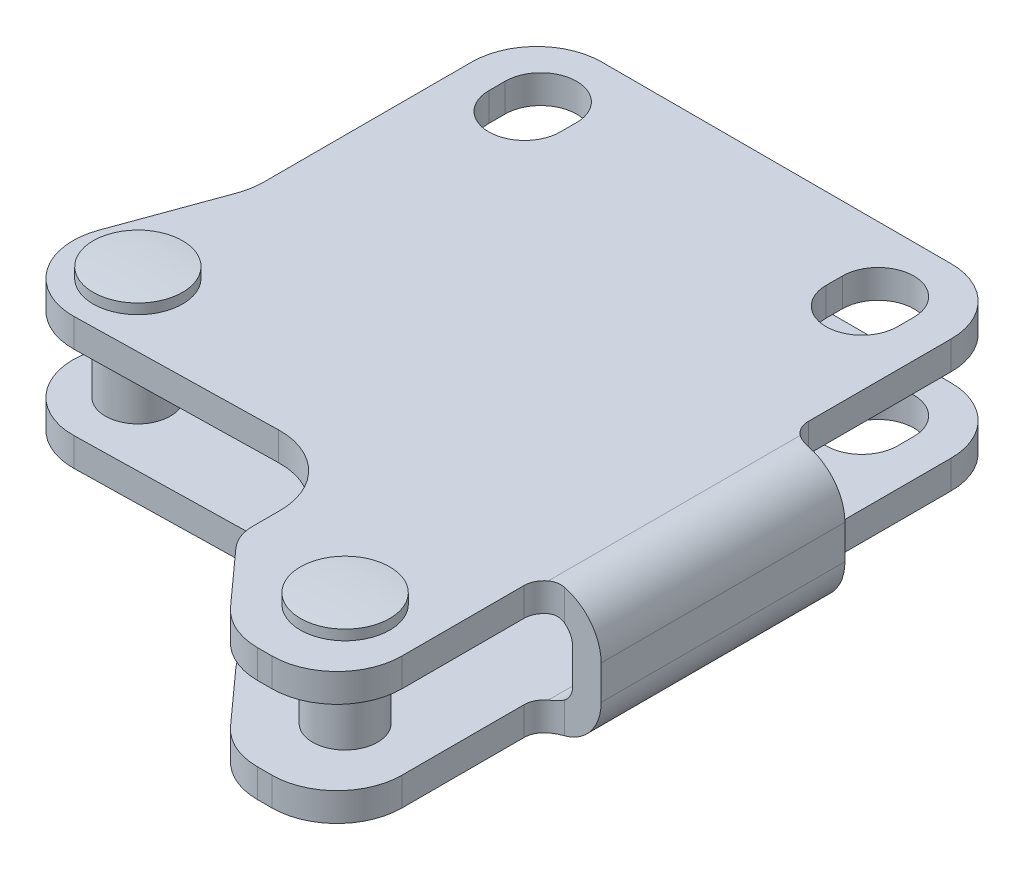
ISO-10303-21;
HEADER;
FILE_DESCRIPTION(('STEP AP214'),'2;1');
FILE_NAME('part.step','',(''),(''),'','','');
FILE_SCHEMA(('AUTOMOTIVE_DESIGN { 1 0 10303 214 1 1 1 1 }'));
ENDSEC;
DATA;
#1=APPLICATION_CONTEXT('core data for automotive mechanical design processes');
#2=APPLICATION_PROTOCOL_DEFINITION('international standard','automotive_design',2000,#1);
#3=PRODUCT_CONTEXT('',#1,'mechanical');
#4=PRODUCT('Part','Part','',(#3));
#5=PRODUCT_RELATED_PRODUCT_CATEGORY('part','',(#4));
#6=PRODUCT_DEFINITION_FORMATION('','',#4);
#7=PRODUCT_DEFINITION_CONTEXT('part definition',#1,'design');
#8=PRODUCT_DEFINITION('design','',#6,#7);
#9=PRODUCT_DEFINITION_SHAPE('','',#8);
#10=(LENGTH_UNIT() NAMED_UNIT(*) SI_UNIT(.MILLI.,.METRE.));
#11=(NAMED_UNIT(*) PLANE_ANGLE_UNIT() SI_UNIT($,.RADIAN.));
#12=(NAMED_UNIT(*) SI_UNIT($,.STERADIAN.) SOLID_ANGLE_UNIT());
#13=UNCERTAINTY_MEASURE_WITH_UNIT(LENGTH_MEASURE(1.E-05),#10,'distance_accuracy_value','');
#14=(GEOMETRIC_REPRESENTATION_CONTEXT(3) GLOBAL_UNCERTAINTY_ASSIGNED_CONTEXT((#13)) GLOBAL_UNIT_ASSIGNED_CONTEXT((#10,
#11,#12)) REPRESENTATION_CONTEXT('',''));
#15=CARTESIAN_POINT('',(0.,0.,0.));
#16=DIRECTION('',(0.,0.,1.));
#17=DIRECTION('',(1.,0.,0.));
#18=AXIS2_PLACEMENT_3D('',#15,#16,#17);
#19=CARTESIAN_POINT('',(0.,8.1,0.));
#20=DIRECTION('',(0.,-1.,0.));
#21=DIRECTION('',(1.,0.,0.));
#22=AXIS2_PLACEMENT_3D('',#19,#20,#21);
#23=CYLINDRICAL_SURFACE('',#22,4.4);
#24=DIRECTION('',(0.,-1.,0.));
#25=VECTOR('',#24,1.);
#26=CARTESIAN_POINT('',(-4.4,8.1,0.));
#27=LINE('',#26,#25);
#28=CARTESIAN_POINT('',(-4.4,8.1,0.));
#29=VERTEX_POINT('',#28);
#30=CARTESIAN_POINT('',(-4.4,4.6,0.));
#31=VERTEX_POINT('',#30);
#32=EDGE_CURVE('E775',#29,#31,#27,.T.);
#33=ORIENTED_EDGE('',*,*,#32,.T.);
#34=CARTESIAN_POINT('',(0.,4.6,0.));
#35=DIRECTION('',(0.,-1.,0.));
#36=DIRECTION('',(1.,0.,0.));
#37=AXIS2_PLACEMENT_3D('',#34,#35,#36);
#38=CIRCLE('',#37,4.4);
#39=CARTESIAN_POINT('',(4.4,4.6,0.));
#40=VERTEX_POINT('',#39);
#41=EDGE_CURVE('E31',#31,#40,#38,.T.);
#42=ORIENTED_EDGE('',*,*,#41,.T.);
#43=DIRECTION('',(0.,-1.,0.));
#44=VECTOR('',#43,1.);
#45=CARTESIAN_POINT('',(4.4,8.1,0.));
#46=LINE('',#45,#44);
#47=CARTESIAN_POINT('',(4.4,8.1,0.));
#48=VERTEX_POINT('',#47);
#49=EDGE_CURVE('E777',#48,#40,#46,.T.);
#50=ORIENTED_EDGE('',*,*,#49,.F.);
#51=CARTESIAN_POINT('',(0.,8.1,0.));
#52=DIRECTION('',(0.,1.,0.));
#53=DIRECTION('',(1.,0.,0.));
#54=AXIS2_PLACEMENT_3D('',#51,#52,#53);
#55=CIRCLE('',#54,4.4);
#56=EDGE_CURVE('E764',#48,#29,#55,.T.);
#57=ORIENTED_EDGE('',*,*,#56,.T.);
#58=EDGE_LOOP('',(#33,#42,#50,#57));
#59=FACE_BOUND('',#58,.T.);
#60=ADVANCED_FACE('F14',(#59),#23,.F.);
#61=CARTESIAN_POINT('',(4.4,8.1,2.));
#62=DIRECTION('',(-1.,0.,0.));
#63=DIRECTION('',(0.,-1.,0.));
#64=AXIS2_PLACEMENT_3D('',#61,#62,#63);
#65=PLANE('',#64);
#66=ORIENTED_EDGE('',*,*,#49,.T.);
#67=DIRECTION('',(0.,0.,1.));
#68=VECTOR('',#67,1.);
#69=CARTESIAN_POINT('',(4.4,4.6,2.));
#70=LINE('',#69,#68);
#71=CARTESIAN_POINT('',(4.4,4.6,2.));
#72=VERTEX_POINT('',#71);
#73=EDGE_CURVE('E1045',#40,#72,#70,.T.);
#74=ORIENTED_EDGE('',*,*,#73,.T.);
#75=DIRECTION('',(0.,-1.,0.));
#76=VECTOR('',#75,1.);
#77=CARTESIAN_POINT('',(4.4,8.1,2.));
#78=LINE('',#77,#76);
#79=CARTESIAN_POINT('',(4.4,8.1,2.));
#80=VERTEX_POINT('',#79);
#81=EDGE_CURVE('E780',#80,#72,#78,.T.);
#82=ORIENTED_EDGE('',*,*,#81,.F.);
#83=DIRECTION('',(0.,0.,-1.));
#84=VECTOR('',#83,1.);
#85=CARTESIAN_POINT('',(4.4,8.1,2.));
#86=LINE('',#85,#84);
#87=EDGE_CURVE('E762',#80,#48,#86,.T.);
#88=ORIENTED_EDGE('',*,*,#87,.T.);
#89=EDGE_LOOP('',(#66,#74,#82,#88));
#90=FACE_BOUND('',#89,.T.);
#91=ADVANCED_FACE('F513',(#90),#65,.T.);
#92=CARTESIAN_POINT('',(0.,8.1,2.));
#93=DIRECTION('',(0.,-1.,0.));
#94=DIRECTION('',(1.,0.,0.));
#95=AXIS2_PLACEMENT_3D('',#92,#93,#94);
#96=CYLINDRICAL_SURFACE('',#95,4.4);
#97=ORIENTED_EDGE('',*,*,#81,.T.);
#98=CARTESIAN_POINT('',(0.,4.6,2.));
#99=DIRECTION('',(0.,-1.,0.));
#100=DIRECTION('',(1.,0.,0.));
#101=AXIS2_PLACEMENT_3D('',#98,#99,#100);
#102=CIRCLE('',#101,4.4);
#103=CARTESIAN_POINT('',(-4.4,4.6,2.));
#104=VERTEX_POINT('',#103);
#105=EDGE_CURVE('E1042',#72,#104,#102,.T.);
#106=ORIENTED_EDGE('',*,*,#105,.T.);
#107=DIRECTION('',(0.,-1.,0.));
#108=VECTOR('',#107,1.);
#109=CARTESIAN_POINT('',(-4.4,8.1,2.));
#110=LINE('',#109,#108);
#111=CARTESIAN_POINT('',(-4.4,8.1,2.));
#112=VERTEX_POINT('',#111);
#113=EDGE_CURVE('E770',#112,#104,#110,.T.);
#114=ORIENTED_EDGE('',*,*,#113,.F.);
#115=CARTESIAN_POINT('',(0.,8.1,2.));
#116=DIRECTION('',(0.,1.,0.));
#117=DIRECTION('',(-1.,0.,0.));
#118=AXIS2_PLACEMENT_3D('',#115,#116,#117);
#119=CIRCLE('',#118,4.4);
#120=EDGE_CURVE('E765',#112,#80,#119,.T.);
#121=ORIENTED_EDGE('',*,*,#120,.T.);
#122=EDGE_LOOP('',(#97,#106,#114,#121));
#123=FACE_BOUND('',#122,.T.);
#124=ADVANCED_FACE('F520',(#123),#96,.F.);
#125=CARTESIAN_POINT('',(-4.4,8.1,0.));
#126=DIRECTION('',(1.,0.,0.));
#127=DIRECTION('',(0.,1.,0.));
#128=AXIS2_PLACEMENT_3D('',#125,#126,#127);
#129=PLANE('',#128);
#130=ORIENTED_EDGE('',*,*,#113,.T.);
#131=DIRECTION('',(0.,0.,-1.));
#132=VECTOR('',#131,1.);
#133=CARTESIAN_POINT('',(-4.4,4.6,0.));
#134=LINE('',#133,#132);
#135=EDGE_CURVE('E1040',#104,#31,#134,.T.);
#136=ORIENTED_EDGE('',*,*,#135,.T.);
#137=ORIENTED_EDGE('',*,*,#32,.F.);
#138=DIRECTION('',(0.,0.,1.));
#139=VECTOR('',#138,1.);
#140=CARTESIAN_POINT('',(-4.4,8.1,0.));
#141=LINE('',#140,#139);
#142=EDGE_CURVE('E768',#29,#112,#141,.T.);
#143=ORIENTED_EDGE('',*,*,#142,.T.);
#144=EDGE_LOOP('',(#130,#136,#137,#143));
#145=FACE_BOUND('',#144,.T.);
#146=ADVANCED_FACE('F525',(#145),#129,.T.);
#147=CARTESIAN_POINT('',(53.0000000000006,-8.1,17.5799999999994));
#148=DIRECTION('',(0.,1.,0.));
#149=DIRECTION('',(-1.,0.,0.));
#150=AXIS2_PLACEMENT_3D('',#147,#148,#149);
#151=CYLINDRICAL_SURFACE('',#150,2.50000000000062);
#152=CARTESIAN_POINT('',(53.,4.10000000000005,20.08));
#153=CARTESIAN_POINT('',(52.9568379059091,4.13238229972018,20.0800051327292));
#154=CARTESIAN_POINT('',(52.9126078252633,4.1633605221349,20.0788820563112));
#155=CARTESIAN_POINT('',(52.8223149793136,4.22235294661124,20.0740864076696));
#156=CARTESIAN_POINT('',(52.7762512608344,4.25036557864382,20.0704124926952));
#157=CARTESIAN_POINT('',(52.6827298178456,4.30318608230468,20.0602311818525));
#158=CARTESIAN_POINT('',(52.6352749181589,4.3279999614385,20.0537292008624));
#159=CARTESIAN_POINT('',(52.5393197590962,4.37434809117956,20.0376708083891));
#160=CARTESIAN_POINT('',(52.4908197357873,4.3958830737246,20.0281150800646));
#161=CARTESIAN_POINT('',(52.3439811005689,4.45559796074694,19.9944779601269));
#162=CARTESIAN_POINT('',(52.244612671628,4.4887150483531,19.9654568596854));
#163=CARTESIAN_POINT('',(52.0473590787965,4.54148256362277,19.8937600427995));
#164=CARTESIAN_POINT('',(51.9494729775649,4.56114188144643,19.8510933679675));
#165=CARTESIAN_POINT('',(51.7924759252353,4.58361776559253,19.7701415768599));
#166=CARTESIAN_POINT('',(51.7318643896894,4.58992907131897,19.7356175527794));
#167=CARTESIAN_POINT('',(51.6135741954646,4.5981238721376,19.6615163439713));
#168=CARTESIAN_POINT('',(51.5558927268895,4.6000116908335,19.6219441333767));
#169=CARTESIAN_POINT('',(51.5,4.6,19.58));
#170=B_SPLINE_CURVE_WITH_KNOTS('',3,(#152,#153,#154,#155,#156,#157,#158,#159,#160,#161,#162,
#163,#164,#165,#166,#167,#168,#169),.UNSPECIFIED.,.F.,.F.,(4,2,2,2,2,2,2,2,4),(0.,
0.161853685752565,0.323792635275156,0.485422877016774,0.647016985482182,0.971256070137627,
1.29528075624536,1.50503643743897,1.71458701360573),.UNSPECIFIED.);
#171=CARTESIAN_POINT('',(53.,4.10000000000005,20.08));
#172=VERTEX_POINT('',#171);
#173=CARTESIAN_POINT('',(51.5,4.6,19.58));
#174=VERTEX_POINT('',#173);
#175=EDGE_CURVE('E449',#172,#174,#170,.T.);
#176=ORIENTED_EDGE('',*,*,#175,.T.);
#177=CARTESIAN_POINT('',(53.0000000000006,4.6,17.5799999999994));
#178=DIRECTION('',(0.,1.,0.));
#179=DIRECTION('',(1.,0.,0.));
#180=AXIS2_PLACEMENT_3D('',#177,#178,#179);
#181=CIRCLE('',#180,2.50000000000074);
#182=CARTESIAN_POINT('',(50.5,4.6,17.5799999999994));
#183=VERTEX_POINT('',#182);
#184=EDGE_CURVE('E428',#183,#174,#181,.T.);
#185=ORIENTED_EDGE('',*,*,#184,.F.);
#186=DIRECTION('',(0.,1.,0.));
#187=VECTOR('',#186,1.);
#188=CARTESIAN_POINT('',(50.5,-8.1,17.5799999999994));
#189=LINE('',#188,#187);
#190=CARTESIAN_POINT('',(50.5,8.1,17.5799999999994));
#191=VERTEX_POINT('',#190);
#192=EDGE_CURVE('E728',#183,#191,#189,.T.);
#193=ORIENTED_EDGE('',*,*,#192,.T.);
#194=CARTESIAN_POINT('',(53.0000000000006,8.1,17.5799999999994));
#195=DIRECTION('',(0.,-1.,0.));
#196=DIRECTION('',(1.,0.,0.));
#197=AXIS2_PLACEMENT_3D('',#194,#195,#196);
#198=CIRCLE('',#197,2.50000000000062);
#199=CARTESIAN_POINT('',(51.5,8.1,19.58));
#200=VERTEX_POINT('',#199);
#201=EDGE_CURVE('E938',#200,#191,#198,.T.);
#202=ORIENTED_EDGE('',*,*,#201,.F.);
#203=CARTESIAN_POINT('',(51.5,8.1,19.58));
#204=CARTESIAN_POINT('',(51.5539025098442,8.10000016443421,19.6204244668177));
#205=CARTESIAN_POINT('',(51.6094088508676,8.09927202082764,19.6586481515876));
#206=CARTESIAN_POINT('',(51.723291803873,8.09611502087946,19.7304787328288));
#207=CARTESIAN_POINT('',(51.7816686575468,8.09368602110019,19.7640852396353));
#208=CARTESIAN_POINT('',(51.9570978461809,8.08368055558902,19.8558229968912));
#209=CARTESIAN_POINT('',(52.0776449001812,8.07341085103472,19.907253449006));
#210=CARTESIAN_POINT('',(52.2648499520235,8.05140302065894,19.9704284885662));
#211=CARTESIAN_POINT('',(52.3295722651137,8.04274107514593,19.9893682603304));
#212=CARTESIAN_POINT('',(52.4600287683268,8.02306391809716,20.0219134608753));
#213=CARTESIAN_POINT('',(52.5257631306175,8.01204830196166,20.0355179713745));
#214=CARTESIAN_POINT('',(52.6596696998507,7.98726892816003,20.0576842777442));
#215=CARTESIAN_POINT('',(52.7278554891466,7.97343210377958,20.0660810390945));
#216=CARTESIAN_POINT('',(52.8641336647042,7.94329065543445,20.0772438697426));
#217=CARTESIAN_POINT('',(52.9322260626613,7.926986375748,20.0800107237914));
#218=CARTESIAN_POINT('',(53.,7.90947501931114,20.08));
#219=B_SPLINE_CURVE_WITH_KNOTS('',3,(#203,#204,#205,#206,#207,#208,#209,#210,#211,#212,#213,
#214,#215,#216,#217,#218),.UNSPECIFIED.,.F.,.F.,(4,2,2,2,2,2,2,4),(0.,0.201993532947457,
0.404004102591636,0.796214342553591,0.999983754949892,1.20378822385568,1.4137592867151,
1.62370107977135),.UNSPECIFIED.);
#220=CARTESIAN_POINT('',(53.,7.90947501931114,20.08));
#221=VERTEX_POINT('',#220);
#222=EDGE_CURVE('E623',#200,#221,#219,.T.);
#223=ORIENTED_EDGE('',*,*,#222,.T.);
#224=DIRECTION('',(0.,1.,0.));
#225=VECTOR('',#224,1.);
#226=CARTESIAN_POINT('',(53.,-8.1,20.08));
#227=LINE('',#226,#225);
#228=EDGE_CURVE('E732',#172,#221,#227,.T.);
#229=ORIENTED_EDGE('',*,*,#228,.F.);
#230=EDGE_LOOP('',(#176,#185,#193,#202,#223,#229));
#231=FACE_BOUND('',#230,.T.);
#232=ADVANCED_FACE('F607',(#231),#151,.F.);
#233=CARTESIAN_POINT('',(50.5,-8.1,17.58));
#234=DIRECTION('',(1.,0.,0.));
#235=DIRECTION('',(0.,1.,0.));
#236=AXIS2_PLACEMENT_3D('',#233,#234,#235);
#237=PLANE('',#236);
#238=ORIENTED_EDGE('',*,*,#192,.F.);
#239=DIRECTION('',(0.,0.,1.));
#240=VECTOR('',#239,1.);
#241=CARTESIAN_POINT('',(50.5,4.6,0.));
#242=LINE('',#241,#240);
#243=CARTESIAN_POINT('',(50.5,4.6,0.));
#244=VERTEX_POINT('',#243);
#245=EDGE_CURVE('E1029',#244,#183,#242,.T.);
#246=ORIENTED_EDGE('',*,*,#245,.F.);
#247=DIRECTION('',(0.,1.,0.));
#248=VECTOR('',#247,1.);
#249=CARTESIAN_POINT('',(50.5,-8.1,0.));
#250=LINE('',#249,#248);
#251=CARTESIAN_POINT('',(50.5,8.1,0.));
#252=VERTEX_POINT('',#251);
#253=EDGE_CURVE('E724',#244,#252,#250,.T.);
#254=ORIENTED_EDGE('',*,*,#253,.T.);
#255=DIRECTION('',(0.,0.,-1.));
#256=VECTOR('',#255,1.);
#257=CARTESIAN_POINT('',(50.5,8.1,17.58));
#258=LINE('',#257,#256);
#259=EDGE_CURVE('E942',#191,#252,#258,.T.);
#260=ORIENTED_EDGE('',*,*,#259,.F.);
#261=EDGE_LOOP('',(#238,#246,#254,#260));
#262=FACE_BOUND('',#261,.T.);
#263=ADVANCED_FACE('F611',(#262),#237,.T.);
#264=CARTESIAN_POINT('',(42.5,-8.1,0.));
#265=DIRECTION('',(0.,1.,0.));
#266=DIRECTION('',(-1.,0.,0.));
#267=AXIS2_PLACEMENT_3D('',#264,#265,#266);
#268=CYLINDRICAL_SURFACE('',#267,8.);
#269=ORIENTED_EDGE('',*,*,#253,.F.);
#270=CARTESIAN_POINT('',(42.5,4.6,0.));
#271=DIRECTION('',(0.,-1.,0.));
#272=DIRECTION('',(1.,0.,0.));
#273=AXIS2_PLACEMENT_3D('',#270,#271,#272);
#274=CIRCLE('',#273,8.);
#275=CARTESIAN_POINT('',(42.5,4.6,-8.));
#276=VERTEX_POINT('',#275);
#277=EDGE_CURVE('E1027',#276,#244,#274,.T.);
#278=ORIENTED_EDGE('',*,*,#277,.F.);
#279=DIRECTION('',(0.,1.,0.));
#280=VECTOR('',#279,1.);
#281=CARTESIAN_POINT('',(42.5,-8.1,-8.));
#282=LINE('',#281,#280);
#283=CARTESIAN_POINT('',(42.5,8.1,-8.));
#284=VERTEX_POINT('',#283);
#285=EDGE_CURVE('E720',#276,#284,#282,.T.);
#286=ORIENTED_EDGE('',*,*,#285,.T.);
#287=CARTESIAN_POINT('',(42.5,8.1,0.));
#288=DIRECTION('',(0.,1.,0.));
#289=DIRECTION('',(-1.,0.,0.));
#290=AXIS2_PLACEMENT_3D('',#287,#288,#289);
#291=CIRCLE('',#290,8.);
#292=EDGE_CURVE('E945',#252,#284,#291,.T.);
#293=ORIENTED_EDGE('',*,*,#292,.F.);
#294=EDGE_LOOP('',(#269,#278,#286,#293));
#295=FACE_BOUND('',#294,.T.);
#296=ADVANCED_FACE('F1507',(#295),#268,.T.);
#297=CARTESIAN_POINT('',(42.5,-8.1,-8.));
#298=DIRECTION('',(0.,0.,-1.));
#299=DIRECTION('',(0.,-1.,0.));
#300=AXIS2_PLACEMENT_3D('',#297,#298,#299);
#301=PLANE('',#300);
#302=ORIENTED_EDGE('',*,*,#285,.F.);
#303=DIRECTION('',(1.,0.,0.));
#304=VECTOR('',#303,1.);
#305=CARTESIAN_POINT('',(-0.499999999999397,4.6,-8.));
#306=LINE('',#305,#304);
#307=CARTESIAN_POINT('',(-0.499999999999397,4.6,-8.));
#308=VERTEX_POINT('',#307);
#309=EDGE_CURVE('E1025',#308,#276,#306,.T.);
#310=ORIENTED_EDGE('',*,*,#309,.F.);
#311=DIRECTION('',(0.,1.,0.));
#312=VECTOR('',#311,1.);
#313=CARTESIAN_POINT('',(-0.499999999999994,-8.1,-8.));
#314=LINE('',#313,#312);
#315=CARTESIAN_POINT('',(-0.499999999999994,8.1,-8.));
#316=VERTEX_POINT('',#315);
#317=EDGE_CURVE('E716',#308,#316,#314,.T.);
#318=ORIENTED_EDGE('',*,*,#317,.T.);
#319=DIRECTION('',(-1.,0.,0.));
#320=VECTOR('',#319,1.);
#321=CARTESIAN_POINT('',(42.5,8.1,-8.));
#322=LINE('',#321,#320);
#323=EDGE_CURVE('E950',#284,#316,#322,.T.);
#324=ORIENTED_EDGE('',*,*,#323,.F.);
#325=EDGE_LOOP('',(#302,#310,#318,#324));
#326=FACE_BOUND('',#325,.T.);
#327=ADVANCED_FACE('F1498',(#326),#301,.T.);
#328=CARTESIAN_POINT('',(-0.499999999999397,-8.1,6.1929628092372E-13));
#329=DIRECTION('',(0.,1.,0.));
#330=DIRECTION('',(-1.,0.,0.));
#331=AXIS2_PLACEMENT_3D('',#328,#329,#330);
#332=CYLINDRICAL_SURFACE('',#331,8.00000000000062);
#333=ORIENTED_EDGE('',*,*,#317,.F.);
#334=CARTESIAN_POINT('',(-0.499999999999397,4.6,6.1929628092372E-13));
#335=DIRECTION('',(0.,-1.,0.));
#336=DIRECTION('',(1.,0.,0.));
#337=AXIS2_PLACEMENT_3D('',#334,#335,#336);
#338=CIRCLE('',#337,8.0000000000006);
#339=CARTESIAN_POINT('',(-8.5,4.6,6.1929628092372E-13));
#340=VERTEX_POINT('',#339);
#341=EDGE_CURVE('E1023',#340,#308,#338,.T.);
#342=ORIENTED_EDGE('',*,*,#341,.F.);
#343=DIRECTION('',(0.,1.,0.));
#344=VECTOR('',#343,1.);
#345=CARTESIAN_POINT('',(-8.5,-8.1,6.1929628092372E-13));
#346=LINE('',#345,#344);
#347=CARTESIAN_POINT('',(-8.5,8.1,6.1929628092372E-13));
#348=VERTEX_POINT('',#347);
#349=EDGE_CURVE('E712',#340,#348,#346,.T.);
#350=ORIENTED_EDGE('',*,*,#349,.T.);
#351=CARTESIAN_POINT('',(-0.499999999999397,8.1,6.1929628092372E-13));
#352=DIRECTION('',(0.,1.,0.));
#353=DIRECTION('',(1.,0.,0.));
#354=AXIS2_PLACEMENT_3D('',#351,#352,#353);
#355=CIRCLE('',#354,8.00000000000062);
#356=EDGE_CURVE('E953',#316,#348,#355,.T.);
#357=ORIENTED_EDGE('',*,*,#356,.F.);
#358=EDGE_LOOP('',(#333,#342,#350,#357));
#359=FACE_BOUND('',#358,.T.);
#360=ADVANCED_FACE('F1488',(#359),#332,.T.);
#361=CARTESIAN_POINT('',(-8.5,-8.1,0.));
#362=DIRECTION('',(-1.,0.,0.));
#363=DIRECTION('',(0.,-1.,0.));
#364=AXIS2_PLACEMENT_3D('',#361,#362,#363);
#365=PLANE('',#364);
#366=ORIENTED_EDGE('',*,*,#349,.F.);
#367=DIRECTION('',(0.,0.,-1.));
#368=VECTOR('',#367,1.);
#369=CARTESIAN_POINT('',(-8.5,4.6,25.64764250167));
#370=LINE('',#369,#368);
#371=CARTESIAN_POINT('',(-8.5,4.6,25.64764250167));
#372=VERTEX_POINT('',#371);
#373=EDGE_CURVE('E1021',#372,#340,#370,.T.);
#374=ORIENTED_EDGE('',*,*,#373,.F.);
#375=DIRECTION('',(0.,1.,0.));
#376=VECTOR('',#375,1.);
#377=CARTESIAN_POINT('',(-8.5,-8.1,25.647642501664));
#378=LINE('',#377,#376);
#379=CARTESIAN_POINT('',(-8.5,8.1,25.647642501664));
#380=VERTEX_POINT('',#379);
#381=EDGE_CURVE('E708',#372,#380,#378,.T.);
#382=ORIENTED_EDGE('',*,*,#381,.T.);
#383=DIRECTION('',(0.,0.,1.));
#384=VECTOR('',#383,1.);
#385=CARTESIAN_POINT('',(-8.5,8.1,0.));
#386=LINE('',#385,#384);
#387=EDGE_CURVE('E956',#348,#380,#386,.T.);
#388=ORIENTED_EDGE('',*,*,#387,.F.);
#389=EDGE_LOOP('',(#366,#374,#382,#388));
#390=FACE_BOUND('',#389,.T.);
#391=ADVANCED_FACE('F1478',(#390),#365,.T.);
#392=CARTESIAN_POINT('',(-16.49999999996,-8.1,25.64764250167));
#393=DIRECTION('',(0.,1.,0.));
#394=DIRECTION('',(-1.,0.,0.));
#395=AXIS2_PLACEMENT_3D('',#392,#393,#394);
#396=CYLINDRICAL_SURFACE('',#395,7.99999999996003);
#397=ORIENTED_EDGE('',*,*,#381,.F.);
#398=CARTESIAN_POINT('',(-16.49999999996,4.6,25.64764250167));
#399=DIRECTION('',(0.,1.,0.));
#400=DIRECTION('',(1.,0.,0.));
#401=AXIS2_PLACEMENT_3D('',#398,#399,#400);
#402=CIRCLE('',#401,7.99999999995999);
#403=CARTESIAN_POINT('',(-8.982459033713,4.6,28.383803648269));
#404=VERTEX_POINT('',#403);
#405=EDGE_CURVE('E1019',#404,#372,#402,.T.);
#406=ORIENTED_EDGE('',*,*,#405,.F.);
#407=DIRECTION('',(0.,1.,0.));
#408=VECTOR('',#407,1.);
#409=CARTESIAN_POINT('',(-8.982459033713,-8.1,28.383803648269));
#410=LINE('',#409,#408);
#411=CARTESIAN_POINT('',(-8.982459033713,8.1,28.383803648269));
#412=VERTEX_POINT('',#411);
#413=EDGE_CURVE('E704',#404,#412,#410,.T.);
#414=ORIENTED_EDGE('',*,*,#413,.T.);
#415=CARTESIAN_POINT('',(-16.49999999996,8.1,25.64764250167));
#416=DIRECTION('',(0.,-1.,0.));
#417=DIRECTION('',(-1.,0.,0.));
#418=AXIS2_PLACEMENT_3D('',#415,#416,#417);
#419=CIRCLE('',#418,7.99999999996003);
#420=EDGE_CURVE('E959',#380,#412,#419,.T.);
#421=ORIENTED_EDGE('',*,*,#420,.F.);
#422=EDGE_LOOP('',(#397,#406,#414,#421));
#423=FACE_BOUND('',#422,.T.);
#424=ADVANCED_FACE('F1468',(#423),#396,.F.);
#425=CARTESIAN_POINT('',(-8.982459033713,-8.1,28.383803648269));
#426=DIRECTION('',(-0.939692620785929,0.,-0.342020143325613));
#427=DIRECTION('',(-0.342020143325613,0.,0.939692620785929));
#428=AXIS2_PLACEMENT_3D('',#425,#426,#427);
#429=PLANE('',#428);
#430=ORIENTED_EDGE('',*,*,#413,.F.);
#431=DIRECTION('',(0.342020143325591,0.,-0.939692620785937));
#432=VECTOR('',#431,1.);
#433=CARTESIAN_POINT('',(-13.5175409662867,4.6,40.8438388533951));
#434=LINE('',#433,#432);
#435=CARTESIAN_POINT('',(-13.517540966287,4.6,40.843838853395));
#436=VERTEX_POINT('',#435);
#437=EDGE_CURVE('E1017',#436,#404,#434,.T.);
#438=ORIENTED_EDGE('',*,*,#437,.F.);
#439=DIRECTION('',(0.,1.,0.));
#440=VECTOR('',#439,1.);
#441=CARTESIAN_POINT('',(-13.517540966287,-8.1,40.843838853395));
#442=LINE('',#441,#440);
#443=CARTESIAN_POINT('',(-13.517540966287,8.1,40.843838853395));
#444=VERTEX_POINT('',#443);
#445=EDGE_CURVE('E700',#436,#444,#442,.T.);
#446=ORIENTED_EDGE('',*,*,#445,.T.);
#447=DIRECTION('',(-0.342020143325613,0.,0.939692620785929));
#448=VECTOR('',#447,1.);
#449=CARTESIAN_POINT('',(-8.982459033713,8.1,28.383803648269));
#450=LINE('',#449,#448);
#451=EDGE_CURVE('E962',#412,#444,#450,.T.);
#452=ORIENTED_EDGE('',*,*,#451,.F.);
#453=EDGE_LOOP('',(#430,#438,#446,#452));
#454=FACE_BOUND('',#453,.T.);
#455=ADVANCED_FACE('F1458',(#454),#429,.T.);
#456=CARTESIAN_POINT('',(-5.9999999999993,-8.1,43.58));
#457=DIRECTION('',(0.,1.,0.));
#458=DIRECTION('',(-1.,0.,0.));
#459=AXIS2_PLACEMENT_3D('',#456,#457,#458);
#460=CYLINDRICAL_SURFACE('',#459,8.00000000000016);
#461=ORIENTED_EDGE('',*,*,#445,.F.);
#462=CARTESIAN_POINT('',(-6.,4.6,43.58));
#463=DIRECTION('',(0.,-1.,0.));
#464=DIRECTION('',(1.,0.,0.));
#465=AXIS2_PLACEMENT_3D('',#462,#463,#464);
#466=CIRCLE('',#465,7.99999999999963);
#467=CARTESIAN_POINT('',(-5.838962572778,4.6,51.578379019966));
#468=VERTEX_POINT('',#467);
#469=EDGE_CURVE('E1015',#468,#436,#466,.T.);
#470=ORIENTED_EDGE('',*,*,#469,.F.);
#471=DIRECTION('',(0.,1.,0.));
#472=VECTOR('',#471,1.);
#473=CARTESIAN_POINT('',(-5.838962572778,-8.1,51.578379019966));
#474=LINE('',#473,#472);
#475=CARTESIAN_POINT('',(-5.838962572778,8.1,51.578379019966));
#476=VERTEX_POINT('',#475);
#477=EDGE_CURVE('E696',#468,#476,#474,.T.);
#478=ORIENTED_EDGE('',*,*,#477,.T.);
#479=CARTESIAN_POINT('',(-5.9999999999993,8.1,43.58));
#480=DIRECTION('',(0.,1.,0.));
#481=DIRECTION('',(1.,0.,0.));
#482=AXIS2_PLACEMENT_3D('',#479,#480,#481);
#483=CIRCLE('',#482,8.00000000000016);
#484=EDGE_CURVE('E965',#444,#476,#483,.T.);
#485=ORIENTED_EDGE('',*,*,#484,.F.);
#486=EDGE_LOOP('',(#461,#470,#478,#485));
#487=FACE_BOUND('',#486,.T.);
#488=ADVANCED_FACE('F1448',(#487),#460,.T.);
#489=CARTESIAN_POINT('',(-5.838962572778,-8.1,51.578379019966));
#490=DIRECTION('',(0.0201296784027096,0.,0.999797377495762));
#491=DIRECTION('',(0.999797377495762,0.,-0.0201296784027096));
#492=AXIS2_PLACEMENT_3D('',#489,#490,#491);
#493=PLANE('',#492);
#494=ORIENTED_EDGE('',*,*,#477,.F.);
#495=DIRECTION('',(-0.999797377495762,0.,0.0201296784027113));
#496=VECTOR('',#495,1.);
#497=CARTESIAN_POINT('',(18.828897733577,4.6,51.081722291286));
#498=LINE('',#497,#496);
#499=CARTESIAN_POINT('',(18.828897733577,4.6,51.081722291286));
#500=VERTEX_POINT('',#499);
#501=EDGE_CURVE('E1013',#500,#468,#498,.T.);
#502=ORIENTED_EDGE('',*,*,#501,.F.);
#503=DIRECTION('',(0.,1.,0.));
#504=VECTOR('',#503,1.);
#505=CARTESIAN_POINT('',(18.828897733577,-8.1,51.081722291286));
#506=LINE('',#505,#504);
#507=CARTESIAN_POINT('',(18.828897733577,8.1,51.081722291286));
#508=VERTEX_POINT('',#507);
#509=EDGE_CURVE('E692',#500,#508,#506,.T.);
#510=ORIENTED_EDGE('',*,*,#509,.T.);
#511=DIRECTION('',(0.999797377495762,0.,-0.0201296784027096));
#512=VECTOR('',#511,1.);
#513=CARTESIAN_POINT('',(-5.838962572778,8.1,51.578379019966));
#514=LINE('',#513,#512);
#515=EDGE_CURVE('E968',#476,#508,#514,.T.);
#516=ORIENTED_EDGE('',*,*,#515,.F.);
#517=EDGE_LOOP('',(#494,#502,#510,#516));
#518=FACE_BOUND('',#517,.T.);
#519=ADVANCED_FACE('F1438',(#518),#493,.T.);
#520=CARTESIAN_POINT('',(19.0000000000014,-8.1,59.5799999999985));
#521=DIRECTION('',(0.,1.,0.));
#522=DIRECTION('',(-1.,0.,0.));
#523=AXIS2_PLACEMENT_3D('',#520,#521,#522);
#524=CYLINDRICAL_SURFACE('',#523,8.49999999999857);
#525=ORIENTED_EDGE('',*,*,#509,.F.);
#526=CARTESIAN_POINT('',(19.0000000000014,4.6,59.5799999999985));
#527=DIRECTION('',(0.,1.,0.));
#528=DIRECTION('',(1.,0.,0.));
#529=AXIS2_PLACEMENT_3D('',#526,#527,#528);
#530=CIRCLE('',#529,8.49999999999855);
#531=CARTESIAN_POINT('',(27.5,4.6,59.58));
#532=VERTEX_POINT('',#531);
#533=EDGE_CURVE('E1011',#532,#500,#530,.T.);
#534=ORIENTED_EDGE('',*,*,#533,.F.);
#535=DIRECTION('',(0.,1.,0.));
#536=VECTOR('',#535,1.);
#537=CARTESIAN_POINT('',(27.5,-8.1,59.58));
#538=LINE('',#537,#536);
#539=CARTESIAN_POINT('',(27.5,8.1,59.58));
#540=VERTEX_POINT('',#539);
#541=EDGE_CURVE('E688',#532,#540,#538,.T.);
#542=ORIENTED_EDGE('',*,*,#541,.T.);
#543=CARTESIAN_POINT('',(19.0000000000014,8.1,59.5799999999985));
#544=DIRECTION('',(0.,-1.,0.));
#545=DIRECTION('',(-1.,0.,0.));
#546=AXIS2_PLACEMENT_3D('',#543,#544,#545);
#547=CIRCLE('',#546,8.49999999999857);
#548=EDGE_CURVE('E971',#508,#540,#547,.T.);
#549=ORIENTED_EDGE('',*,*,#548,.F.);
#550=EDGE_LOOP('',(#525,#534,#542,#549));
#551=FACE_BOUND('',#550,.T.);
#552=ADVANCED_FACE('F1428',(#551),#524,.F.);
#553=CARTESIAN_POINT('',(27.5,-8.1,59.58));
#554=DIRECTION('',(-1.,0.,0.));
#555=DIRECTION('',(0.,-1.,0.));
#556=AXIS2_PLACEMENT_3D('',#553,#554,#555);
#557=PLANE('',#556);
#558=ORIENTED_EDGE('',*,*,#541,.F.);
#559=DIRECTION('',(0.,0.,-1.));
#560=VECTOR('',#559,1.);
#561=CARTESIAN_POINT('',(27.5,4.6,62.956407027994));
#562=LINE('',#561,#560);
#563=CARTESIAN_POINT('',(27.5,4.6,62.956407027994));
#564=VERTEX_POINT('',#563);
#565=EDGE_CURVE('E1009',#564,#532,#562,.T.);
#566=ORIENTED_EDGE('',*,*,#565,.F.);
#567=DIRECTION('',(0.,1.,0.));
#568=VECTOR('',#567,1.);
#569=CARTESIAN_POINT('',(27.5,-8.1,62.956407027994));
#570=LINE('',#569,#568);
#571=CARTESIAN_POINT('',(27.5,8.1,62.956407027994));
#572=VERTEX_POINT('',#571);
#573=EDGE_CURVE('E684',#564,#572,#570,.T.);
#574=ORIENTED_EDGE('',*,*,#573,.T.);
#575=DIRECTION('',(0.,0.,1.));
#576=VECTOR('',#575,1.);
#577=CARTESIAN_POINT('',(27.5,8.1,59.58));
#578=LINE('',#577,#576);
#579=EDGE_CURVE('E974',#540,#572,#578,.T.);
#580=ORIENTED_EDGE('',*,*,#579,.F.);
#581=EDGE_LOOP('',(#558,#566,#574,#580));
#582=FACE_BOUND('',#581,.T.);
#583=ADVANCED_FACE('F1418',(#582),#557,.T.);
#584=CARTESIAN_POINT('',(32.5000000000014,-8.1,62.9564070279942));
#585=DIRECTION('',(0.,1.,0.));
#586=DIRECTION('',(-1.,0.,0.));
#587=AXIS2_PLACEMENT_3D('',#584,#585,#586);
#588=CYLINDRICAL_SURFACE('',#587,5.00000000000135);
#589=ORIENTED_EDGE('',*,*,#573,.F.);
#590=CARTESIAN_POINT('',(32.5000000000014,4.6,62.9564070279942));
#591=DIRECTION('',(0.,-1.,0.));
#592=DIRECTION('',(1.,0.,0.));
#593=AXIS2_PLACEMENT_3D('',#590,#591,#592);
#594=CIRCLE('',#593,5.00000000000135);
#595=CARTESIAN_POINT('',(28.784275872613,4.6,66.302060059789));
#596=VERTEX_POINT('',#595);
#597=EDGE_CURVE('E1007',#596,#564,#594,.T.);
#598=ORIENTED_EDGE('',*,*,#597,.F.);
#599=DIRECTION('',(0.,1.,0.));
#600=VECTOR('',#599,1.);
#601=CARTESIAN_POINT('',(28.784275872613,-8.1,66.302060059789));
#602=LINE('',#601,#600);
#603=CARTESIAN_POINT('',(28.784275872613,8.1,66.302060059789));
#604=VERTEX_POINT('',#603);
#605=EDGE_CURVE('E680',#596,#604,#602,.T.);
#606=ORIENTED_EDGE('',*,*,#605,.T.);
#607=CARTESIAN_POINT('',(32.5000000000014,8.1,62.9564070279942));
#608=DIRECTION('',(0.,1.,0.));
#609=DIRECTION('',(-1.,0.,0.));
#610=AXIS2_PLACEMENT_3D('',#607,#608,#609);
#611=CIRCLE('',#610,5.00000000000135);
#612=EDGE_CURVE('E977',#572,#604,#611,.T.);
#613=ORIENTED_EDGE('',*,*,#612,.F.);
#614=EDGE_LOOP('',(#589,#598,#606,#613));
#615=FACE_BOUND('',#614,.T.);
#616=ADVANCED_FACE('F1408',(#615),#588,.T.);
#617=CARTESIAN_POINT('',(28.784275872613,-8.1,66.302060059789));
#618=DIRECTION('',(-0.743144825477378,0.,0.669130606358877));
#619=DIRECTION('',(0.669130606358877,0.,0.743144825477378));
#620=AXIS2_PLACEMENT_3D('',#617,#618,#619);
#621=PLANE('',#620);
#622=ORIENTED_EDGE('',*,*,#605,.F.);
#623=DIRECTION('',(-0.669130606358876,0.,-0.743144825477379));
#624=VECTOR('',#623,1.);
#625=CARTESIAN_POINT('',(34.754841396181,4.6,72.933044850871));
#626=LINE('',#625,#624);
#627=CARTESIAN_POINT('',(34.754841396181,4.6,72.933044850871));
#628=VERTEX_POINT('',#627);
#629=EDGE_CURVE('E1005',#628,#596,#626,.T.);
#630=ORIENTED_EDGE('',*,*,#629,.F.);
#631=DIRECTION('',(0.,1.,0.));
#632=VECTOR('',#631,1.);
#633=CARTESIAN_POINT('',(34.754841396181,-8.1,72.933044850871));
#634=LINE('',#633,#632);
#635=CARTESIAN_POINT('',(34.754841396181,8.1,72.933044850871));
#636=VERTEX_POINT('',#635);
#637=EDGE_CURVE('E676',#628,#636,#634,.T.);
#638=ORIENTED_EDGE('',*,*,#637,.T.);
#639=DIRECTION('',(0.669130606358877,0.,0.743144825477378));
#640=VECTOR('',#639,1.);
#641=CARTESIAN_POINT('',(28.784275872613,8.1,66.302060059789));
#642=LINE('',#641,#640);
#643=EDGE_CURVE('E980',#604,#636,#642,.T.);
#644=ORIENTED_EDGE('',*,*,#643,.F.);
#645=EDGE_LOOP('',(#622,#630,#638,#644));
#646=FACE_BOUND('',#645,.T.);
#647=ADVANCED_FACE('F1398',(#646),#621,.T.);
#648=CARTESIAN_POINT('',(40.7,-8.1,67.58));
#649=DIRECTION('',(0.,1.,0.));
#650=DIRECTION('',(-1.,0.,0.));
#651=AXIS2_PLACEMENT_3D('',#648,#649,#650);
#652=CYLINDRICAL_SURFACE('',#651,7.99999999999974);
#653=ORIENTED_EDGE('',*,*,#637,.F.);
#654=CARTESIAN_POINT('',(40.7,4.6,67.58));
#655=DIRECTION('',(0.,-1.,0.));
#656=DIRECTION('',(1.,0.,0.));
#657=AXIS2_PLACEMENT_3D('',#654,#655,#656);
#658=CIRCLE('',#657,8.);
#659=CARTESIAN_POINT('',(40.7,4.6,75.58));
#660=VERTEX_POINT('',#659);
#661=EDGE_CURVE('E1003',#660,#628,#658,.T.);
#662=ORIENTED_EDGE('',*,*,#661,.F.);
#663=DIRECTION('',(0.,1.,0.));
#664=VECTOR('',#663,1.);
#665=CARTESIAN_POINT('',(40.7,-8.1,75.58));
#666=LINE('',#665,#664);
#667=CARTESIAN_POINT('',(40.7,8.1,75.58));
#668=VERTEX_POINT('',#667);
#669=EDGE_CURVE('E672',#660,#668,#666,.T.);
#670=ORIENTED_EDGE('',*,*,#669,.T.);
#671=CARTESIAN_POINT('',(40.7,8.1,67.58));
#672=DIRECTION('',(0.,1.,0.));
#673=DIRECTION('',(-1.,0.,0.));
#674=AXIS2_PLACEMENT_3D('',#671,#672,#673);
#675=CIRCLE('',#674,7.99999999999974);
#676=EDGE_CURVE('E983',#636,#668,#675,.T.);
#677=ORIENTED_EDGE('',*,*,#676,.F.);
#678=EDGE_LOOP('',(#653,#662,#670,#677));
#679=FACE_BOUND('',#678,.T.);
#680=ADVANCED_FACE('F1388',(#679),#652,.T.);
#681=CARTESIAN_POINT('',(40.7,-8.1,75.58));
#682=DIRECTION('',(0.,0.,1.));
#683=DIRECTION('',(0.,1.,0.));
#684=AXIS2_PLACEMENT_3D('',#681,#682,#683);
#685=PLANE('',#684);
#686=ORIENTED_EDGE('',*,*,#669,.F.);
#687=DIRECTION('',(-1.,0.,0.));
#688=VECTOR('',#687,1.);
#689=CARTESIAN_POINT('',(42.5,4.6,75.58));
#690=LINE('',#689,#688);
#691=CARTESIAN_POINT('',(42.5,4.6,75.58));
#692=VERTEX_POINT('',#691);
#693=EDGE_CURVE('E998',#692,#660,#690,.T.);
#694=ORIENTED_EDGE('',*,*,#693,.F.);
#695=DIRECTION('',(0.,1.,0.));
#696=VECTOR('',#695,1.);
#697=CARTESIAN_POINT('',(42.5,-8.1,75.58));
#698=LINE('',#697,#696);
#699=CARTESIAN_POINT('',(42.5,8.1,75.58));
#700=VERTEX_POINT('',#699);
#701=EDGE_CURVE('E668',#692,#700,#698,.T.);
#702=ORIENTED_EDGE('',*,*,#701,.T.);
#703=DIRECTION('',(1.,0.,0.));
#704=VECTOR('',#703,1.);
#705=CARTESIAN_POINT('',(40.7,8.1,75.58));
#706=LINE('',#705,#704);
#707=EDGE_CURVE('E986',#668,#700,#706,.T.);
#708=ORIENTED_EDGE('',*,*,#707,.F.);
#709=EDGE_LOOP('',(#686,#694,#702,#708));
#710=FACE_BOUND('',#709,.T.);
#711=ADVANCED_FACE('F1378',(#710),#685,.T.);
#712=CARTESIAN_POINT('',(42.4999999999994,-8.1,67.58));
#713=DIRECTION('',(0.,1.,0.));
#714=DIRECTION('',(-1.,0.,0.));
#715=AXIS2_PLACEMENT_3D('',#712,#713,#714);
#716=CYLINDRICAL_SURFACE('',#715,8.00000000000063);
#717=ORIENTED_EDGE('',*,*,#701,.F.);
#718=CARTESIAN_POINT('',(42.4999999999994,4.6,67.58));
#719=DIRECTION('',(0.,-1.,0.));
#720=DIRECTION('',(1.,0.,0.));
#721=AXIS2_PLACEMENT_3D('',#718,#719,#720);
#722=CIRCLE('',#721,8.00000000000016);
#723=CARTESIAN_POINT('',(50.5,4.6,67.58));
#724=VERTEX_POINT('',#723);
#725=EDGE_CURVE('E996',#724,#692,#722,.T.);
#726=ORIENTED_EDGE('',*,*,#725,.F.);
#727=DIRECTION('',(0.,1.,0.));
#728=VECTOR('',#727,1.);
#729=CARTESIAN_POINT('',(50.5,-8.1,67.58));
#730=LINE('',#729,#728);
#731=CARTESIAN_POINT('',(50.5,8.1,67.58));
#732=VERTEX_POINT('',#731);
#733=EDGE_CURVE('E664',#724,#732,#730,.T.);
#734=ORIENTED_EDGE('',*,*,#733,.T.);
#735=CARTESIAN_POINT('',(42.4999999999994,8.1,67.58));
#736=DIRECTION('',(0.,1.,0.));
#737=DIRECTION('',(-1.,0.,0.));
#738=AXIS2_PLACEMENT_3D('',#735,#736,#737);
#739=CIRCLE('',#738,8.00000000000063);
#740=EDGE_CURVE('E880',#700,#732,#739,.T.);
#741=ORIENTED_EDGE('',*,*,#740,.F.);
#742=EDGE_LOOP('',(#717,#726,#734,#741));
#743=FACE_BOUND('',#742,.T.);
#744=ADVANCED_FACE('F1368',(#743),#716,.T.);
#745=CARTESIAN_POINT('',(50.5,-8.1,67.58));
#746=DIRECTION('',(1.,0.,0.));
#747=DIRECTION('',(0.,1.,0.));
#748=AXIS2_PLACEMENT_3D('',#745,#746,#747);
#749=PLANE('',#748);
#750=ORIENTED_EDGE('',*,*,#733,.F.);
#751=DIRECTION('',(0.,0.,1.));
#752=VECTOR('',#751,1.);
#753=CARTESIAN_POINT('',(50.5,4.6,52.58));
#754=LINE('',#753,#752);
#755=CARTESIAN_POINT('',(50.5,4.6,52.58));
#756=VERTEX_POINT('',#755);
#757=EDGE_CURVE('E444',#756,#724,#754,.T.);
#758=ORIENTED_EDGE('',*,*,#757,.F.);
#759=DIRECTION('',(0.,1.,0.));
#760=VECTOR('',#759,1.);
#761=CARTESIAN_POINT('',(50.5,-8.1,52.58));
#762=LINE('',#761,#760);
#763=CARTESIAN_POINT('',(50.5,8.1,52.58));
#764=VERTEX_POINT('',#763);
#765=EDGE_CURVE('E443',#756,#764,#762,.T.);
#766=ORIENTED_EDGE('',*,*,#765,.T.);
#767=DIRECTION('',(0.,0.,-1.));
#768=VECTOR('',#767,1.);
#769=CARTESIAN_POINT('',(50.5,8.1,67.58));
#770=LINE('',#769,#768);
#771=EDGE_CURVE('E875',#732,#764,#770,.T.);
#772=ORIENTED_EDGE('',*,*,#771,.F.);
#773=EDGE_LOOP('',(#750,#758,#766,#772));
#774=FACE_BOUND('',#773,.T.);
#775=ADVANCED_FACE('F994',(#774),#749,.T.);
#776=CARTESIAN_POINT('',(53.0000000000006,-8.1,52.58));
#777=DIRECTION('',(0.,1.,0.));
#778=DIRECTION('',(-1.,0.,0.));
#779=AXIS2_PLACEMENT_3D('',#776,#777,#778);
#780=CYLINDRICAL_SURFACE('',#779,2.50000000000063);
#781=ORIENTED_EDGE('',*,*,#765,.F.);
#782=CARTESIAN_POINT('',(53.0000000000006,4.6,52.58));
#783=DIRECTION('',(0.,1.,0.));
#784=DIRECTION('',(1.,0.,0.));
#785=AXIS2_PLACEMENT_3D('',#782,#783,#784);
#786=CIRCLE('',#785,2.50000000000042);
#787=CARTESIAN_POINT('',(51.5,4.6,50.58));
#788=VERTEX_POINT('',#787);
#789=EDGE_CURVE('E425',#788,#756,#786,.T.);
#790=ORIENTED_EDGE('',*,*,#789,.F.);
#791=CARTESIAN_POINT('',(51.5,4.6,50.58));
#792=CARTESIAN_POINT('',(51.5431620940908,4.60000513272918,50.5476177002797));
#793=CARTESIAN_POINT('',(51.5873921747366,4.59888205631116,50.5166394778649));
#794=CARTESIAN_POINT('',(51.6776850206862,4.59408640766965,50.4576470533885));
#795=CARTESIAN_POINT('',(51.7237487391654,4.59041249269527,50.4296344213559));
#796=CARTESIAN_POINT('',(51.8172701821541,4.58023118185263,50.376813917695));
#797=CARTESIAN_POINT('',(51.8647250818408,4.57372920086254,50.3520000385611));
#798=CARTESIAN_POINT('',(51.9606802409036,4.55767080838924,50.3056519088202));
#799=CARTESIAN_POINT('',(52.0091802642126,4.5481150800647,50.2841169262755));
#800=CARTESIAN_POINT('',(52.1560188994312,4.51447796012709,50.2244020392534));
#801=CARTESIAN_POINT('',(52.2553873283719,4.48545685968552,50.1912849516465));
#802=CARTESIAN_POINT('',(52.4526409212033,4.41376004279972,50.1385174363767));
#803=CARTESIAN_POINT('',(52.5505270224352,4.3710933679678,50.1188581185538));
#804=CARTESIAN_POINT('',(52.7075240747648,4.29014157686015,50.0963822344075));
#805=CARTESIAN_POINT('',(52.7681356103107,4.25561755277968,50.0900709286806));
#806=CARTESIAN_POINT('',(52.8864258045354,4.18151634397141,50.0818761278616));
#807=CARTESIAN_POINT('',(52.9441072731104,4.14194413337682,50.0799883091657));
#808=CARTESIAN_POINT('',(53.,4.10000000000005,50.08));
#809=B_SPLINE_CURVE_WITH_KNOTS('',3,(#791,#792,#793,#794,#795,#796,#797,#798,#799,#800,#801,
#802,#803,#804,#805,#806,#807,#808),.UNSPECIFIED.,.F.,.F.,(4,2,2,2,2,2,2,2,4),(0.,
0.161853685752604,0.323792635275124,0.485422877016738,0.647016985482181,0.971256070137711,
1.29528075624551,1.50503643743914,1.71458701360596),.UNSPECIFIED.);
#810=CARTESIAN_POINT('',(53.,4.10000000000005,50.08));
#811=VERTEX_POINT('',#810);
#812=EDGE_CURVE('E440',#788,#811,#809,.T.);
#813=ORIENTED_EDGE('',*,*,#812,.T.);
#814=DIRECTION('',(0.,1.,0.));
#815=VECTOR('',#814,1.);
#816=CARTESIAN_POINT('',(53.,-8.1,50.08));
#817=LINE('',#816,#815);
#818=CARTESIAN_POINT('',(53.,7.90947501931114,50.08));
#819=VERTEX_POINT('',#818);
#820=EDGE_CURVE('E655',#811,#819,#817,.T.);
#821=ORIENTED_EDGE('',*,*,#820,.T.);
#822=CARTESIAN_POINT('',(53.,7.90947501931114,50.08));
#823=CARTESIAN_POINT('',(52.9347818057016,7.92632517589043,50.0799899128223));
#824=CARTESIAN_POINT('',(52.8692670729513,7.94205897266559,50.0825518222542));
#825=CARTESIAN_POINT('',(52.7381347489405,7.97124353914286,50.092885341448));
#826=CARTESIAN_POINT('',(52.672517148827,7.9846941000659,50.100657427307));
#827=CARTESIAN_POINT('',(52.543534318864,8.0089109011,50.1211821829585));
#828=CARTESIAN_POINT('',(52.480157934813,8.01974238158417,50.1337875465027));
#829=CARTESIAN_POINT('',(52.3542645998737,8.03921600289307,50.1639671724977));
#830=CARTESIAN_POINT('',(52.2917475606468,8.04785837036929,50.1815409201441));
#831=CARTESIAN_POINT('',(52.1657018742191,8.0633064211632,50.2223531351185));
#832=CARTESIAN_POINT('',(52.1022243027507,8.07003033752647,50.2457806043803));
#833=CARTESIAN_POINT('',(51.9772080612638,8.0813221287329,50.2977900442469));
#834=CARTESIAN_POINT('',(51.9156697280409,8.08588963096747,50.3263729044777));
#835=CARTESIAN_POINT('',(51.7932075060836,8.0931544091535,50.3894443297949));
#836=CARTESIAN_POINT('',(51.7323586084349,8.0957908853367,50.4240854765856));
#837=CARTESIAN_POINT('',(51.613746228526,8.09921688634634,50.498363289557));
#838=CARTESIAN_POINT('',(51.5559823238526,8.10000666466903,50.5379992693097));
#839=CARTESIAN_POINT('',(51.5,8.1,50.58));
#840=B_SPLINE_CURVE_WITH_KNOTS('',3,(#822,#823,#824,#825,#826,#827,#828,#829,#830,#831,#832,
#833,#834,#835,#836,#837,#838,#839),.UNSPECIFIED.,.F.,.F.,(4,2,2,2,2,2,2,2,4),(0.,
0.202032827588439,0.404084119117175,0.600412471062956,0.796720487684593,1.00044829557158,
1.20421129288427,1.41414247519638,1.62404483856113),.UNSPECIFIED.);
#841=CARTESIAN_POINT('',(51.5,8.1,50.58));
#842=VERTEX_POINT('',#841);
#843=EDGE_CURVE('E632',#819,#842,#840,.T.);
#844=ORIENTED_EDGE('',*,*,#843,.T.);
#845=CARTESIAN_POINT('',(53.0000000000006,8.1,52.58));
#846=DIRECTION('',(0.,-1.,0.));
#847=DIRECTION('',(-1.,0.,0.));
#848=AXIS2_PLACEMENT_3D('',#845,#846,#847);
#849=CIRCLE('',#848,2.50000000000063);
#850=EDGE_CURVE('E865',#764,#842,#849,.T.);
#851=ORIENTED_EDGE('',*,*,#850,.F.);
#852=EDGE_LOOP('',(#781,#790,#813,#821,#844,#851));
#853=FACE_BOUND('',#852,.T.);
#854=ADVANCED_FACE('F438',(#853),#780,.F.);
#855=CARTESIAN_POINT('',(41.5,8.1,0.));
#856=DIRECTION('',(0.,-1.,0.));
#857=DIRECTION('',(1.,0.,0.));
#858=AXIS2_PLACEMENT_3D('',#855,#856,#857);
#859=CYLINDRICAL_SURFACE('',#858,4.4);
#860=DIRECTION('',(0.,-1.,0.));
#861=VECTOR('',#860,1.);
#862=CARTESIAN_POINT('',(37.1,8.1,0.));
#863=LINE('',#862,#861);
#864=CARTESIAN_POINT('',(37.1,8.1,0.));
#865=VERTEX_POINT('',#864);
#866=CARTESIAN_POINT('',(37.1,4.6,0.));
#867=VERTEX_POINT('',#866);
#868=EDGE_CURVE('E819',#865,#867,#863,.T.);
#869=ORIENTED_EDGE('',*,*,#868,.T.);
#870=CARTESIAN_POINT('',(41.5,4.6,0.));
#871=DIRECTION('',(0.,-1.,0.));
#872=DIRECTION('',(1.,0.,0.));
#873=AXIS2_PLACEMENT_3D('',#870,#871,#872);
#874=CIRCLE('',#873,4.4);
#875=CARTESIAN_POINT('',(45.9,4.6,0.));
#876=VERTEX_POINT('',#875);
#877=EDGE_CURVE('E39',#867,#876,#874,.T.);
#878=ORIENTED_EDGE('',*,*,#877,.T.);
#879=DIRECTION('',(0.,-1.,0.));
#880=VECTOR('',#879,1.);
#881=CARTESIAN_POINT('',(45.9,8.1,0.));
#882=LINE('',#881,#880);
#883=CARTESIAN_POINT('',(45.9,8.1,0.));
#884=VERTEX_POINT('',#883);
#885=EDGE_CURVE('E822',#884,#876,#882,.T.);
#886=ORIENTED_EDGE('',*,*,#885,.F.);
#887=CARTESIAN_POINT('',(41.5,8.1,0.));
#888=DIRECTION('',(0.,1.,0.));
#889=DIRECTION('',(1.,0.,0.));
#890=AXIS2_PLACEMENT_3D('',#887,#888,#889);
#891=CIRCLE('',#890,4.4);
#892=EDGE_CURVE('E810',#884,#865,#891,.T.);
#893=ORIENTED_EDGE('',*,*,#892,.T.);
#894=EDGE_LOOP('',(#869,#878,#886,#893));
#895=FACE_BOUND('',#894,.T.);
#896=ADVANCED_FACE('F555',(#895),#859,.F.);
#897=CARTESIAN_POINT('',(45.9,8.1,2.));
#898=DIRECTION('',(-1.,0.,0.));
#899=DIRECTION('',(0.,-1.,0.));
#900=AXIS2_PLACEMENT_3D('',#897,#898,#899);
#901=PLANE('',#900);
#902=ORIENTED_EDGE('',*,*,#885,.T.);
#903=DIRECTION('',(0.,0.,1.));
#904=VECTOR('',#903,1.);
#905=CARTESIAN_POINT('',(45.9,4.6,2.));
#906=LINE('',#905,#904);
#907=CARTESIAN_POINT('',(45.9,4.6,2.));
#908=VERTEX_POINT('',#907);
#909=EDGE_CURVE('E1036',#876,#908,#906,.T.);
#910=ORIENTED_EDGE('',*,*,#909,.T.);
#911=DIRECTION('',(0.,-1.,0.));
#912=VECTOR('',#911,1.);
#913=CARTESIAN_POINT('',(45.9,8.1,2.));
#914=LINE('',#913,#912);
#915=CARTESIAN_POINT('',(45.9,8.1,2.));
#916=VERTEX_POINT('',#915);
#917=EDGE_CURVE('E825',#916,#908,#914,.T.);
#918=ORIENTED_EDGE('',*,*,#917,.F.);
#919=DIRECTION('',(0.,0.,-1.));
#920=VECTOR('',#919,1.);
#921=CARTESIAN_POINT('',(45.9,8.1,2.));
#922=LINE('',#921,#920);
#923=EDGE_CURVE('E808',#916,#884,#922,.T.);
#924=ORIENTED_EDGE('',*,*,#923,.T.);
#925=EDGE_LOOP('',(#902,#910,#918,#924));
#926=FACE_BOUND('',#925,.T.);
#927=ADVANCED_FACE('F558',(#926),#901,.T.);
#928=CARTESIAN_POINT('',(41.5,8.1,2.));
#929=DIRECTION('',(0.,-1.,0.));
#930=DIRECTION('',(1.,0.,0.));
#931=AXIS2_PLACEMENT_3D('',#928,#929,#930);
#932=CYLINDRICAL_SURFACE('',#931,4.4);
#933=ORIENTED_EDGE('',*,*,#917,.T.);
#934=CARTESIAN_POINT('',(41.5,4.6,2.));
#935=DIRECTION('',(0.,-1.,0.));
#936=DIRECTION('',(1.,0.,0.));
#937=AXIS2_PLACEMENT_3D('',#934,#935,#936);
#938=CIRCLE('',#937,4.4);
#939=CARTESIAN_POINT('',(37.1,4.6,2.));
#940=VERTEX_POINT('',#939);
#941=EDGE_CURVE('E1033',#908,#940,#938,.T.);
#942=ORIENTED_EDGE('',*,*,#941,.T.);
#943=DIRECTION('',(0.,-1.,0.));
#944=VECTOR('',#943,1.);
#945=CARTESIAN_POINT('',(37.1,8.1,2.));
#946=LINE('',#945,#944);
#947=CARTESIAN_POINT('',(37.1,8.1,2.));
#948=VERTEX_POINT('',#947);
#949=EDGE_CURVE('E815',#948,#940,#946,.T.);
#950=ORIENTED_EDGE('',*,*,#949,.F.);
#951=CARTESIAN_POINT('',(41.5,8.1,2.));
#952=DIRECTION('',(0.,1.,0.));
#953=DIRECTION('',(-1.,0.,0.));
#954=AXIS2_PLACEMENT_3D('',#951,#952,#953);
#955=CIRCLE('',#954,4.4);
#956=EDGE_CURVE('E807',#948,#916,#955,.T.);
#957=ORIENTED_EDGE('',*,*,#956,.T.);
#958=EDGE_LOOP('',(#933,#942,#950,#957));
#959=FACE_BOUND('',#958,.T.);
#960=ADVANCED_FACE('F553',(#959),#932,.F.);
#961=CARTESIAN_POINT('',(37.1,8.1,0.));
#962=DIRECTION('',(1.,0.,0.));
#963=DIRECTION('',(0.,1.,0.));
#964=AXIS2_PLACEMENT_3D('',#961,#962,#963);
#965=PLANE('',#964);
#966=ORIENTED_EDGE('',*,*,#949,.T.);
#967=DIRECTION('',(0.,0.,-1.));
#968=VECTOR('',#967,1.);
#969=CARTESIAN_POINT('',(37.1,4.6,0.));
#970=LINE('',#969,#968);
#971=EDGE_CURVE('E1031',#940,#867,#970,.T.);
#972=ORIENTED_EDGE('',*,*,#971,.T.);
#973=ORIENTED_EDGE('',*,*,#868,.F.);
#974=DIRECTION('',(0.,0.,1.));
#975=VECTOR('',#974,1.);
#976=CARTESIAN_POINT('',(37.1,8.1,0.));
#977=LINE('',#976,#975);
#978=EDGE_CURVE('E813',#865,#948,#977,.T.);
#979=ORIENTED_EDGE('',*,*,#978,.T.);
#980=EDGE_LOOP('',(#966,#972,#973,#979));
#981=FACE_BOUND('',#980,.T.);
#982=ADVANCED_FACE('F549',(#981),#965,.T.);
#983=CARTESIAN_POINT('',(50.5,-8.1,17.5799999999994));
#984=VERTEX_POINT('',#983);
#985=CARTESIAN_POINT('',(50.5,-4.6,17.5799999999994));
#986=VERTEX_POINT('',#985);
#987=EDGE_CURVE('E729',#984,#986,#189,.T.);
#988=ORIENTED_EDGE('',*,*,#987,.T.);
#989=CARTESIAN_POINT('',(53.0000000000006,-4.6,17.5799999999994));
#990=DIRECTION('',(0.,-1.,0.));
#991=DIRECTION('',(-1.,0.,0.));
#992=AXIS2_PLACEMENT_3D('',#989,#990,#991);
#993=CIRCLE('',#992,2.50000000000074);
#994=CARTESIAN_POINT('',(51.5,-4.6,19.58));
#995=VERTEX_POINT('',#994);
#996=EDGE_CURVE('E1055',#995,#986,#993,.T.);
#997=ORIENTED_EDGE('',*,*,#996,.F.);
#998=CARTESIAN_POINT('',(51.5,-4.6,19.58));
#999=CARTESIAN_POINT('',(51.5431620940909,-4.60000513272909,19.61238229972));
#1000=CARTESIAN_POINT('',(51.5873921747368,-4.59888205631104,19.6433605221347));
#1001=CARTESIAN_POINT('',(51.6776850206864,-4.59408640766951,19.702352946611));
#1002=CARTESIAN_POINT('',(51.7237487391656,-4.59041249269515,19.7303655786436));
#1003=CARTESIAN_POINT('',(51.8172701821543,-4.58023118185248,19.7831860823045));
#1004=CARTESIAN_POINT('',(51.864725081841,-4.57372920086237,19.8079999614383));
#1005=CARTESIAN_POINT('',(51.9606802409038,-4.55767080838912,19.8543480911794));
#1006=CARTESIAN_POINT('',(52.0091802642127,-4.54811508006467,19.8758830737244));
#1007=CARTESIAN_POINT('',(52.1560188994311,-4.51447796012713,19.9355979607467));
#1008=CARTESIAN_POINT('',(52.2553873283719,-4.48545685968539,19.9687150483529));
#1009=CARTESIAN_POINT('',(52.4526409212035,-4.41376004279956,20.0214825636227));
#1010=CARTESIAN_POINT('',(52.5505270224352,-4.3710933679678,20.0411418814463));
#1011=CARTESIAN_POINT('',(52.7075240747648,-4.29014157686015,20.0636177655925));
#1012=CARTESIAN_POINT('',(52.7681356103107,-4.25561755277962,20.0699290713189));
#1013=CARTESIAN_POINT('',(52.8864258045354,-4.18151634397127,20.0781238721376));
#1014=CARTESIAN_POINT('',(52.9441072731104,-4.14194413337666,20.0800116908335));
#1015=CARTESIAN_POINT('',(53.,-4.1,20.08));
#1016=B_SPLINE_CURVE_WITH_KNOTS('',3,(#998,#999,#1000,#1001,#1002,#1003,#1004,#1005,#1006,#1007,
#1008,#1009,#1010,#1011,#1012,#1013,#1014,#1015),.UNSPECIFIED.,.F.,.F.,(4,2,2,2,2,2,2,2,4),(0.,
0.161853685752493,0.323792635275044,0.485422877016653,0.647016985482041,0.971256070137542,
1.29528075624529,1.5050364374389,1.71458701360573),.UNSPECIFIED.);
#1017=CARTESIAN_POINT('',(53.,-4.1,20.08));
#1018=VERTEX_POINT('',#1017);
#1019=EDGE_CURVE('E455',#995,#1018,#1016,.T.);
#1020=ORIENTED_EDGE('',*,*,#1019,.T.);
#1021=CARTESIAN_POINT('',(53.,-7.90947501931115,20.08));
#1022=VERTEX_POINT('',#1021);
#1023=EDGE_CURVE('E733',#1022,#1018,#227,.T.);
#1024=ORIENTED_EDGE('',*,*,#1023,.F.);
#1025=CARTESIAN_POINT('',(53.,-7.90947501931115,20.08));
#1026=CARTESIAN_POINT('',(52.9347818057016,-7.92632517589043,20.0800100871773));
#1027=CARTESIAN_POINT('',(52.8692670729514,-7.94205897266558,20.0774481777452));
#1028=CARTESIAN_POINT('',(52.7381347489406,-7.97124353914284,20.0671146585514));
#1029=CARTESIAN_POINT('',(52.672517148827,-7.98469410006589,20.0593425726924));
#1030=CARTESIAN_POINT('',(52.5435343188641,-8.00891090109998,20.0388178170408));
#1031=CARTESIAN_POINT('',(52.4801579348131,-8.01974238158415,20.0262124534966));
#1032=CARTESIAN_POINT('',(52.3542645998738,-8.03921600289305,19.9960328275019));
#1033=CARTESIAN_POINT('',(52.2917475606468,-8.04785837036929,19.9784590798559));
#1034=CARTESIAN_POINT('',(52.1657018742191,-8.0633064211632,19.9376468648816));
#1035=CARTESIAN_POINT('',(52.1022243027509,-8.07003033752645,19.9142193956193));
#1036=CARTESIAN_POINT('',(51.9772080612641,-8.08132212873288,19.8622099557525));
#1037=CARTESIAN_POINT('',(51.9156697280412,-8.08588963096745,19.8336270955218));
#1038=CARTESIAN_POINT('',(51.7932075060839,-8.09315440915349,19.7705556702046));
#1039=CARTESIAN_POINT('',(51.7323586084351,-8.09579088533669,19.7359145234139));
#1040=CARTESIAN_POINT('',(51.6137462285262,-8.09921688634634,19.6616367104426));
#1041=CARTESIAN_POINT('',(51.5559823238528,-8.10000666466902,19.62200073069));
#1042=CARTESIAN_POINT('',(51.5,-8.1,19.58));
#1043=B_SPLINE_CURVE_WITH_KNOTS('',3,(#1025,#1026,#1027,#1028,#1029,#1030,#1031,#1032,#1033,
#1034,#1035,#1036,#1037,#1038,#1039,#1040,#1041,#1042),.UNSPECIFIED.,.F.,.F.,(4,2,2,2,2,2,2,2,
4),(0.,0.20203282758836,0.404084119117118,0.600412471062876,0.796720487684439,1.00044829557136,
1.20421129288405,1.41414247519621,1.62404483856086),.UNSPECIFIED.);
#1044=CARTESIAN_POINT('',(51.5,-8.1,19.58));
#1045=VERTEX_POINT('',#1044);
#1046=EDGE_CURVE('E598',#1022,#1045,#1043,.T.);
#1047=ORIENTED_EDGE('',*,*,#1046,.T.);
#1048=CARTESIAN_POINT('',(53.0000000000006,-8.1,17.5799999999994));
#1049=DIRECTION('',(0.,-1.,0.));
#1050=DIRECTION('',(1.,0.,0.));
#1051=AXIS2_PLACEMENT_3D('',#1048,#1049,#1050);
#1052=CIRCLE('',#1051,2.50000000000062);
#1053=EDGE_CURVE('E876',#1045,#984,#1052,.T.);
#1054=ORIENTED_EDGE('',*,*,#1053,.T.);
#1055=EDGE_LOOP('',(#988,#997,#1020,#1024,#1047,#1054));
#1056=FACE_BOUND('',#1055,.T.);
#1057=ADVANCED_FACE('F552',(#1056),#151,.F.);
#1058=CARTESIAN_POINT('',(50.5,-8.1,0.));
#1059=VERTEX_POINT('',#1058);
#1060=CARTESIAN_POINT('',(50.5,-4.6,0.));
#1061=VERTEX_POINT('',#1060);
#1062=EDGE_CURVE('E725',#1059,#1061,#250,.T.);
#1063=ORIENTED_EDGE('',*,*,#1062,.T.);
#1064=DIRECTION('',(0.,0.,-1.));
#1065=VECTOR('',#1064,1.);
#1066=CARTESIAN_POINT('',(50.5,-4.6,17.5799999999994));
#1067=LINE('',#1066,#1065);
#1068=EDGE_CURVE('E1057',#986,#1061,#1067,.T.);
#1069=ORIENTED_EDGE('',*,*,#1068,.F.);
#1070=ORIENTED_EDGE('',*,*,#987,.F.);
#1071=DIRECTION('',(0.,0.,-1.));
#1072=VECTOR('',#1071,1.);
#1073=CARTESIAN_POINT('',(50.5,-8.1,17.58));
#1074=LINE('',#1073,#1072);
#1075=EDGE_CURVE('E878',#984,#1059,#1074,.T.);
#1076=ORIENTED_EDGE('',*,*,#1075,.T.);
#1077=EDGE_LOOP('',(#1063,#1069,#1070,#1076));
#1078=FACE_BOUND('',#1077,.T.);
#1079=ADVANCED_FACE('F1505',(#1078),#237,.T.);
#1080=CARTESIAN_POINT('',(42.5,-8.1,-8.));
#1081=VERTEX_POINT('',#1080);
#1082=CARTESIAN_POINT('',(42.5,-4.6,-8.));
#1083=VERTEX_POINT('',#1082);
#1084=EDGE_CURVE('E721',#1081,#1083,#282,.T.);
#1085=ORIENTED_EDGE('',*,*,#1084,.T.);
#1086=CARTESIAN_POINT('',(42.5,-4.6,0.));
#1087=DIRECTION('',(0.,1.,0.));
#1088=DIRECTION('',(-1.,0.,0.));
#1089=AXIS2_PLACEMENT_3D('',#1086,#1087,#1088);
#1090=CIRCLE('',#1089,8.);
#1091=EDGE_CURVE('E1059',#1061,#1083,#1090,.T.);
#1092=ORIENTED_EDGE('',*,*,#1091,.F.);
#1093=ORIENTED_EDGE('',*,*,#1062,.F.);
#1094=CARTESIAN_POINT('',(42.5,-8.1,0.));
#1095=DIRECTION('',(0.,1.,0.));
#1096=DIRECTION('',(-1.,0.,0.));
#1097=AXIS2_PLACEMENT_3D('',#1094,#1095,#1096);
#1098=CIRCLE('',#1097,8.);
#1099=EDGE_CURVE('E886',#1059,#1081,#1098,.T.);
#1100=ORIENTED_EDGE('',*,*,#1099,.T.);
#1101=EDGE_LOOP('',(#1085,#1092,#1093,#1100));
#1102=FACE_BOUND('',#1101,.T.);
#1103=ADVANCED_FACE('F1495',(#1102),#268,.T.);
#1104=CARTESIAN_POINT('',(-0.499999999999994,-8.1,-8.));
#1105=VERTEX_POINT('',#1104);
#1106=CARTESIAN_POINT('',(-0.499999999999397,-4.6,-8.));
#1107=VERTEX_POINT('',#1106);
#1108=EDGE_CURVE('E717',#1105,#1107,#314,.T.);
#1109=ORIENTED_EDGE('',*,*,#1108,.T.);
#1110=DIRECTION('',(-1.,0.,0.));
#1111=VECTOR('',#1110,1.);
#1112=CARTESIAN_POINT('',(42.5,-4.6,-8.));
#1113=LINE('',#1112,#1111);
#1114=EDGE_CURVE('E1061',#1083,#1107,#1113,.T.);
#1115=ORIENTED_EDGE('',*,*,#1114,.F.);
#1116=ORIENTED_EDGE('',*,*,#1084,.F.);
#1117=DIRECTION('',(-1.,0.,0.));
#1118=VECTOR('',#1117,1.);
#1119=CARTESIAN_POINT('',(42.5,-8.1,-8.));
#1120=LINE('',#1119,#1118);
#1121=EDGE_CURVE('E888',#1081,#1105,#1120,.T.);
#1122=ORIENTED_EDGE('',*,*,#1121,.T.);
#1123=EDGE_LOOP('',(#1109,#1115,#1116,#1122));
#1124=FACE_BOUND('',#1123,.T.);
#1125=ADVANCED_FACE('F1485',(#1124),#301,.T.);
#1126=CARTESIAN_POINT('',(-8.5,-8.1,6.1929628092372E-13));
#1127=VERTEX_POINT('',#1126);
#1128=CARTESIAN_POINT('',(-8.5,-4.6,6.1929628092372E-13));
#1129=VERTEX_POINT('',#1128);
#1130=EDGE_CURVE('E713',#1127,#1129,#346,.T.);
#1131=ORIENTED_EDGE('',*,*,#1130,.T.);
#1132=CARTESIAN_POINT('',(-0.499999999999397,-4.6,6.1929628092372E-13));
#1133=DIRECTION('',(0.,1.,0.));
#1134=DIRECTION('',(-1.,0.,0.));
#1135=AXIS2_PLACEMENT_3D('',#1132,#1133,#1134);
#1136=CIRCLE('',#1135,8.0000000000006);
#1137=EDGE_CURVE('E1063',#1107,#1129,#1136,.T.);
#1138=ORIENTED_EDGE('',*,*,#1137,.F.);
#1139=ORIENTED_EDGE('',*,*,#1108,.F.);
#1140=CARTESIAN_POINT('',(-0.499999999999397,-8.1,6.1929628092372E-13));
#1141=DIRECTION('',(0.,1.,0.));
#1142=DIRECTION('',(1.,0.,0.));
#1143=AXIS2_PLACEMENT_3D('',#1140,#1141,#1142);
#1144=CIRCLE('',#1143,8.00000000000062);
#1145=EDGE_CURVE('E891',#1105,#1127,#1144,.T.);
#1146=ORIENTED_EDGE('',*,*,#1145,.T.);
#1147=EDGE_LOOP('',(#1131,#1138,#1139,#1146));
#1148=FACE_BOUND('',#1147,.T.);
#1149=ADVANCED_FACE('F1475',(#1148),#332,.T.);
#1150=CARTESIAN_POINT('',(-8.5,-8.1,25.647642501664));
#1151=VERTEX_POINT('',#1150);
#1152=CARTESIAN_POINT('',(-8.5,-4.6,25.647642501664));
#1153=VERTEX_POINT('',#1152);
#1154=EDGE_CURVE('E709',#1151,#1153,#378,.T.);
#1155=ORIENTED_EDGE('',*,*,#1154,.T.);
#1156=DIRECTION('',(0.,0.,1.));
#1157=VECTOR('',#1156,1.);
#1158=CARTESIAN_POINT('',(-8.5,-4.6,6.1929628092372E-13));
#1159=LINE('',#1158,#1157);
#1160=EDGE_CURVE('E1065',#1129,#1153,#1159,.T.);
#1161=ORIENTED_EDGE('',*,*,#1160,.F.);
#1162=ORIENTED_EDGE('',*,*,#1130,.F.);
#1163=DIRECTION('',(0.,0.,1.));
#1164=VECTOR('',#1163,1.);
#1165=CARTESIAN_POINT('',(-8.5,-8.1,0.));
#1166=LINE('',#1165,#1164);
#1167=EDGE_CURVE('E894',#1127,#1151,#1166,.T.);
#1168=ORIENTED_EDGE('',*,*,#1167,.T.);
#1169=EDGE_LOOP('',(#1155,#1161,#1162,#1168));
#1170=FACE_BOUND('',#1169,.T.);
#1171=ADVANCED_FACE('F1465',(#1170),#365,.T.);
#1172=CARTESIAN_POINT('',(-8.982459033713,-8.1,28.383803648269));
#1173=VERTEX_POINT('',#1172);
#1174=CARTESIAN_POINT('',(-8.982459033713,-4.6,28.383803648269));
#1175=VERTEX_POINT('',#1174);
#1176=EDGE_CURVE('E705',#1173,#1175,#410,.T.);
#1177=ORIENTED_EDGE('',*,*,#1176,.T.);
#1178=CARTESIAN_POINT('',(-16.49999999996,-4.6,25.64764250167));
#1179=DIRECTION('',(0.,-1.,0.));
#1180=DIRECTION('',(-1.,0.,0.));
#1181=AXIS2_PLACEMENT_3D('',#1178,#1179,#1180);
#1182=CIRCLE('',#1181,7.99999999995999);
#1183=EDGE_CURVE('E1067',#1153,#1175,#1182,.T.);
#1184=ORIENTED_EDGE('',*,*,#1183,.F.);
#1185=ORIENTED_EDGE('',*,*,#1154,.F.);
#1186=CARTESIAN_POINT('',(-16.49999999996,-8.1,25.64764250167));
#1187=DIRECTION('',(0.,-1.,0.));
#1188=DIRECTION('',(-1.,0.,0.));
#1189=AXIS2_PLACEMENT_3D('',#1186,#1187,#1188);
#1190=CIRCLE('',#1189,7.99999999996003);
#1191=EDGE_CURVE('E897',#1151,#1173,#1190,.T.);
#1192=ORIENTED_EDGE('',*,*,#1191,.T.);
#1193=EDGE_LOOP('',(#1177,#1184,#1185,#1192));
#1194=FACE_BOUND('',#1193,.T.);
#1195=ADVANCED_FACE('F1455',(#1194),#396,.F.);
#1196=CARTESIAN_POINT('',(-13.517540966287,-8.1,40.843838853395));
#1197=VERTEX_POINT('',#1196);
#1198=CARTESIAN_POINT('',(-13.517540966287,-4.6,40.843838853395));
#1199=VERTEX_POINT('',#1198);
#1200=EDGE_CURVE('E701',#1197,#1199,#442,.T.);
#1201=ORIENTED_EDGE('',*,*,#1200,.T.);
#1202=DIRECTION('',(-0.34202014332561,0.,0.93969262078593));
#1203=VECTOR('',#1202,1.);
#1204=CARTESIAN_POINT('',(-8.982459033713,-4.6,28.383803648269));
#1205=LINE('',#1204,#1203);
#1206=EDGE_CURVE('E1069',#1175,#1199,#1205,.T.);
#1207=ORIENTED_EDGE('',*,*,#1206,.F.);
#1208=ORIENTED_EDGE('',*,*,#1176,.F.);
#1209=DIRECTION('',(-0.342020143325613,0.,0.939692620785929));
#1210=VECTOR('',#1209,1.);
#1211=CARTESIAN_POINT('',(-8.982459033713,-8.1,28.383803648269));
#1212=LINE('',#1211,#1210);
#1213=EDGE_CURVE('E900',#1173,#1197,#1212,.T.);
#1214=ORIENTED_EDGE('',*,*,#1213,.T.);
#1215=EDGE_LOOP('',(#1201,#1207,#1208,#1214));
#1216=FACE_BOUND('',#1215,.T.);
#1217=ADVANCED_FACE('F1445',(#1216),#429,.T.);
#1218=CARTESIAN_POINT('',(-5.838962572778,-8.1,51.578379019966));
#1219=VERTEX_POINT('',#1218);
#1220=CARTESIAN_POINT('',(-5.838962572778,-4.6,51.578379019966));
#1221=VERTEX_POINT('',#1220);
#1222=EDGE_CURVE('E697',#1219,#1221,#474,.T.);
#1223=ORIENTED_EDGE('',*,*,#1222,.T.);
#1224=CARTESIAN_POINT('',(-6.,-4.6,43.58));
#1225=DIRECTION('',(0.,1.,0.));
#1226=DIRECTION('',(-1.,0.,0.));
#1227=AXIS2_PLACEMENT_3D('',#1224,#1225,#1226);
#1228=CIRCLE('',#1227,7.9999999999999);
#1229=EDGE_CURVE('E1071',#1199,#1221,#1228,.T.);
#1230=ORIENTED_EDGE('',*,*,#1229,.F.);
#1231=ORIENTED_EDGE('',*,*,#1200,.F.);
#1232=CARTESIAN_POINT('',(-5.9999999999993,-8.1,43.58));
#1233=DIRECTION('',(0.,1.,0.));
#1234=DIRECTION('',(1.,0.,0.));
#1235=AXIS2_PLACEMENT_3D('',#1232,#1233,#1234);
#1236=CIRCLE('',#1235,8.00000000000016);
#1237=EDGE_CURVE('E903',#1197,#1219,#1236,.T.);
#1238=ORIENTED_EDGE('',*,*,#1237,.T.);
#1239=EDGE_LOOP('',(#1223,#1230,#1231,#1238));
#1240=FACE_BOUND('',#1239,.T.);
#1241=ADVANCED_FACE('F1435',(#1240),#460,.T.);
#1242=CARTESIAN_POINT('',(18.828897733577,-8.1,51.081722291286));
#1243=VERTEX_POINT('',#1242);
#1244=CARTESIAN_POINT('',(18.828897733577,-4.6,51.081722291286));
#1245=VERTEX_POINT('',#1244);
#1246=EDGE_CURVE('E693',#1243,#1245,#506,.T.);
#1247=ORIENTED_EDGE('',*,*,#1246,.T.);
#1248=DIRECTION('',(0.999797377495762,0.,-0.0201296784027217));
#1249=VECTOR('',#1248,1.);
#1250=CARTESIAN_POINT('',(-5.838962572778,-4.6,51.5783790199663));
#1251=LINE('',#1250,#1249);
#1252=EDGE_CURVE('E1073',#1221,#1245,#1251,.T.);
#1253=ORIENTED_EDGE('',*,*,#1252,.F.);
#1254=ORIENTED_EDGE('',*,*,#1222,.F.);
#1255=DIRECTION('',(0.999797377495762,0.,-0.0201296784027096));
#1256=VECTOR('',#1255,1.);
#1257=CARTESIAN_POINT('',(-5.838962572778,-8.1,51.578379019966));
#1258=LINE('',#1257,#1256);
#1259=EDGE_CURVE('E906',#1219,#1243,#1258,.T.);
#1260=ORIENTED_EDGE('',*,*,#1259,.T.);
#1261=EDGE_LOOP('',(#1247,#1253,#1254,#1260));
#1262=FACE_BOUND('',#1261,.T.);
#1263=ADVANCED_FACE('F1425',(#1262),#493,.T.);
#1264=CARTESIAN_POINT('',(27.5,-8.1,59.58));
#1265=VERTEX_POINT('',#1264);
#1266=CARTESIAN_POINT('',(27.5,-4.6,59.58));
#1267=VERTEX_POINT('',#1266);
#1268=EDGE_CURVE('E689',#1265,#1267,#538,.T.);
#1269=ORIENTED_EDGE('',*,*,#1268,.T.);
#1270=CARTESIAN_POINT('',(19.0000000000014,-4.6,59.5799999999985));
#1271=DIRECTION('',(0.,-1.,0.));
#1272=DIRECTION('',(-1.,0.,0.));
#1273=AXIS2_PLACEMENT_3D('',#1270,#1271,#1272);
#1274=CIRCLE('',#1273,8.49999999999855);
#1275=EDGE_CURVE('E1075',#1245,#1267,#1274,.T.);
#1276=ORIENTED_EDGE('',*,*,#1275,.F.);
#1277=ORIENTED_EDGE('',*,*,#1246,.F.);
#1278=CARTESIAN_POINT('',(19.0000000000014,-8.1,59.5799999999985));
#1279=DIRECTION('',(0.,-1.,0.));
#1280=DIRECTION('',(-1.,0.,0.));
#1281=AXIS2_PLACEMENT_3D('',#1278,#1279,#1280);
#1282=CIRCLE('',#1281,8.49999999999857);
#1283=EDGE_CURVE('E909',#1243,#1265,#1282,.T.);
#1284=ORIENTED_EDGE('',*,*,#1283,.T.);
#1285=EDGE_LOOP('',(#1269,#1276,#1277,#1284));
#1286=FACE_BOUND('',#1285,.T.);
#1287=ADVANCED_FACE('F1415',(#1286),#524,.F.);
#1288=CARTESIAN_POINT('',(27.5,-8.1,62.956407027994));
#1289=VERTEX_POINT('',#1288);
#1290=CARTESIAN_POINT('',(27.5,-4.6,62.9564070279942));
#1291=VERTEX_POINT('',#1290);
#1292=EDGE_CURVE('E685',#1289,#1291,#570,.T.);
#1293=ORIENTED_EDGE('',*,*,#1292,.T.);
#1294=DIRECTION('',(0.,0.,1.));
#1295=VECTOR('',#1294,1.);
#1296=CARTESIAN_POINT('',(27.5,-4.6,59.58));
#1297=LINE('',#1296,#1295);
#1298=EDGE_CURVE('E1077',#1267,#1291,#1297,.T.);
#1299=ORIENTED_EDGE('',*,*,#1298,.F.);
#1300=ORIENTED_EDGE('',*,*,#1268,.F.);
#1301=DIRECTION('',(0.,0.,1.));
#1302=VECTOR('',#1301,1.);
#1303=CARTESIAN_POINT('',(27.5,-8.1,59.58));
#1304=LINE('',#1303,#1302);
#1305=EDGE_CURVE('E912',#1265,#1289,#1304,.T.);
#1306=ORIENTED_EDGE('',*,*,#1305,.T.);
#1307=EDGE_LOOP('',(#1293,#1299,#1300,#1306));
#1308=FACE_BOUND('',#1307,.T.);
#1309=ADVANCED_FACE('F1405',(#1308),#557,.T.);
#1310=CARTESIAN_POINT('',(28.784275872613,-8.1,66.302060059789));
#1311=VERTEX_POINT('',#1310);
#1312=CARTESIAN_POINT('',(28.784275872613,-4.6,66.302060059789));
#1313=VERTEX_POINT('',#1312);
#1314=EDGE_CURVE('E681',#1311,#1313,#602,.T.);
#1315=ORIENTED_EDGE('',*,*,#1314,.T.);
#1316=CARTESIAN_POINT('',(32.5000000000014,-4.6,62.9564070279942));
#1317=DIRECTION('',(0.,1.,0.));
#1318=DIRECTION('',(-1.,0.,0.));
#1319=AXIS2_PLACEMENT_3D('',#1316,#1317,#1318);
#1320=CIRCLE('',#1319,5.00000000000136);
#1321=EDGE_CURVE('E1079',#1291,#1313,#1320,.T.);
#1322=ORIENTED_EDGE('',*,*,#1321,.F.);
#1323=ORIENTED_EDGE('',*,*,#1292,.F.);
#1324=CARTESIAN_POINT('',(32.5000000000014,-8.1,62.9564070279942));
#1325=DIRECTION('',(0.,1.,0.));
#1326=DIRECTION('',(-1.,0.,0.));
#1327=AXIS2_PLACEMENT_3D('',#1324,#1325,#1326);
#1328=CIRCLE('',#1327,5.00000000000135);
#1329=EDGE_CURVE('E915',#1289,#1311,#1328,.T.);
#1330=ORIENTED_EDGE('',*,*,#1329,.T.);
#1331=EDGE_LOOP('',(#1315,#1322,#1323,#1330));
#1332=FACE_BOUND('',#1331,.T.);
#1333=ADVANCED_FACE('F1395',(#1332),#588,.T.);
#1334=CARTESIAN_POINT('',(34.754841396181,-8.1,72.933044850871));
#1335=VERTEX_POINT('',#1334);
#1336=CARTESIAN_POINT('',(34.754841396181,-4.6,72.933044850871));
#1337=VERTEX_POINT('',#1336);
#1338=EDGE_CURVE('E677',#1335,#1337,#634,.T.);
#1339=ORIENTED_EDGE('',*,*,#1338,.T.);
#1340=DIRECTION('',(0.669130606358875,0.,0.743144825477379));
#1341=VECTOR('',#1340,1.);
#1342=CARTESIAN_POINT('',(28.784275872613,-4.6,66.302060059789));
#1343=LINE('',#1342,#1341);
#1344=EDGE_CURVE('E1081',#1313,#1337,#1343,.T.);
#1345=ORIENTED_EDGE('',*,*,#1344,.F.);
#1346=ORIENTED_EDGE('',*,*,#1314,.F.);
#1347=DIRECTION('',(0.669130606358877,0.,0.743144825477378));
#1348=VECTOR('',#1347,1.);
#1349=CARTESIAN_POINT('',(28.784275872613,-8.1,66.302060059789));
#1350=LINE('',#1349,#1348);
#1351=EDGE_CURVE('E918',#1311,#1335,#1350,.T.);
#1352=ORIENTED_EDGE('',*,*,#1351,.T.);
#1353=EDGE_LOOP('',(#1339,#1345,#1346,#1352));
#1354=FACE_BOUND('',#1353,.T.);
#1355=ADVANCED_FACE('F1385',(#1354),#621,.T.);
#1356=CARTESIAN_POINT('',(40.7,-8.1,75.58));
#1357=VERTEX_POINT('',#1356);
#1358=CARTESIAN_POINT('',(40.7,-4.6,75.58));
#1359=VERTEX_POINT('',#1358);
#1360=EDGE_CURVE('E673',#1357,#1359,#666,.T.);
#1361=ORIENTED_EDGE('',*,*,#1360,.T.);
#1362=CARTESIAN_POINT('',(40.7,-4.6,67.58));
#1363=DIRECTION('',(0.,1.,0.));
#1364=DIRECTION('',(-1.,0.,0.));
#1365=AXIS2_PLACEMENT_3D('',#1362,#1363,#1364);
#1366=CIRCLE('',#1365,8.);
#1367=EDGE_CURVE('E1083',#1337,#1359,#1366,.T.);
#1368=ORIENTED_EDGE('',*,*,#1367,.F.);
#1369=ORIENTED_EDGE('',*,*,#1338,.F.);
#1370=CARTESIAN_POINT('',(40.7,-8.1,67.58));
#1371=DIRECTION('',(0.,1.,0.));
#1372=DIRECTION('',(-1.,0.,0.));
#1373=AXIS2_PLACEMENT_3D('',#1370,#1371,#1372);
#1374=CIRCLE('',#1373,7.99999999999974);
#1375=EDGE_CURVE('E921',#1335,#1357,#1374,.T.);
#1376=ORIENTED_EDGE('',*,*,#1375,.T.);
#1377=EDGE_LOOP('',(#1361,#1368,#1369,#1376));
#1378=FACE_BOUND('',#1377,.T.);
#1379=ADVANCED_FACE('F1375',(#1378),#652,.T.);
#1380=CARTESIAN_POINT('',(42.5,-8.1,75.58));
#1381=VERTEX_POINT('',#1380);
#1382=CARTESIAN_POINT('',(42.5,-4.6,75.58));
#1383=VERTEX_POINT('',#1382);
#1384=EDGE_CURVE('E669',#1381,#1383,#698,.T.);
#1385=ORIENTED_EDGE('',*,*,#1384,.T.);
#1386=DIRECTION('',(1.,0.,0.));
#1387=VECTOR('',#1386,1.);
#1388=CARTESIAN_POINT('',(40.7,-4.6,75.58));
#1389=LINE('',#1388,#1387);
#1390=EDGE_CURVE('E1085',#1359,#1383,#1389,.T.);
#1391=ORIENTED_EDGE('',*,*,#1390,.F.);
#1392=ORIENTED_EDGE('',*,*,#1360,.F.);
#1393=DIRECTION('',(1.,0.,0.));
#1394=VECTOR('',#1393,1.);
#1395=CARTESIAN_POINT('',(40.7,-8.1,75.58));
#1396=LINE('',#1395,#1394);
#1397=EDGE_CURVE('E924',#1357,#1381,#1396,.T.);
#1398=ORIENTED_EDGE('',*,*,#1397,.T.);
#1399=EDGE_LOOP('',(#1385,#1391,#1392,#1398));
#1400=FACE_BOUND('',#1399,.T.);
#1401=ADVANCED_FACE('F1365',(#1400),#685,.T.);
#1402=CARTESIAN_POINT('',(50.5,-8.1,67.58));
#1403=VERTEX_POINT('',#1402);
#1404=CARTESIAN_POINT('',(50.5,-4.6,67.58));
#1405=VERTEX_POINT('',#1404);
#1406=EDGE_CURVE('E665',#1403,#1405,#730,.T.);
#1407=ORIENTED_EDGE('',*,*,#1406,.T.);
#1408=CARTESIAN_POINT('',(42.4999999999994,-4.6,67.58));
#1409=DIRECTION('',(0.,1.,0.));
#1410=DIRECTION('',(-1.,0.,0.));
#1411=AXIS2_PLACEMENT_3D('',#1408,#1409,#1410);
#1412=CIRCLE('',#1411,8.00000000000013);
#1413=EDGE_CURVE('E1087',#1383,#1405,#1412,.T.);
#1414=ORIENTED_EDGE('',*,*,#1413,.F.);
#1415=ORIENTED_EDGE('',*,*,#1384,.F.);
#1416=CARTESIAN_POINT('',(42.4999999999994,-8.1,67.58));
#1417=DIRECTION('',(0.,1.,0.));
#1418=DIRECTION('',(-1.,0.,0.));
#1419=AXIS2_PLACEMENT_3D('',#1416,#1417,#1418);
#1420=CIRCLE('',#1419,8.00000000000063);
#1421=EDGE_CURVE('E927',#1381,#1403,#1420,.T.);
#1422=ORIENTED_EDGE('',*,*,#1421,.T.);
#1423=EDGE_LOOP('',(#1407,#1414,#1415,#1422));
#1424=FACE_BOUND('',#1423,.T.);
#1425=ADVANCED_FACE('F1357',(#1424),#716,.T.);
#1426=CARTESIAN_POINT('',(50.5,-8.1,52.58));
#1427=VERTEX_POINT('',#1426);
#1428=CARTESIAN_POINT('',(50.5,-4.6,52.58));
#1429=VERTEX_POINT('',#1428);
#1430=EDGE_CURVE('E657',#1427,#1429,#762,.T.);
#1431=ORIENTED_EDGE('',*,*,#1430,.T.);
#1432=DIRECTION('',(0.,0.,-1.));
#1433=VECTOR('',#1432,1.);
#1434=CARTESIAN_POINT('',(50.5,-4.6,67.58));
#1435=LINE('',#1434,#1433);
#1436=EDGE_CURVE('E1089',#1405,#1429,#1435,.T.);
#1437=ORIENTED_EDGE('',*,*,#1436,.F.);
#1438=ORIENTED_EDGE('',*,*,#1406,.F.);
#1439=DIRECTION('',(0.,0.,-1.));
#1440=VECTOR('',#1439,1.);
#1441=CARTESIAN_POINT('',(50.5,-8.1,67.58));
#1442=LINE('',#1441,#1440);
#1443=EDGE_CURVE('E929',#1403,#1427,#1442,.T.);
#1444=ORIENTED_EDGE('',*,*,#1443,.T.);
#1445=EDGE_LOOP('',(#1431,#1437,#1438,#1444));
#1446=FACE_BOUND('',#1445,.T.);
#1447=ADVANCED_FACE('F1350',(#1446),#749,.T.);
#1448=CARTESIAN_POINT('',(53.,-4.1,50.08));
#1449=CARTESIAN_POINT('',(52.956837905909,-4.13238229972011,50.0799948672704));
#1450=CARTESIAN_POINT('',(52.9126078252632,-4.16336052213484,50.0811179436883));
#1451=CARTESIAN_POINT('',(52.8223149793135,-4.22235294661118,50.0859135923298));
#1452=CARTESIAN_POINT('',(52.7762512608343,-4.25036557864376,50.0895875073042));
#1453=CARTESIAN_POINT('',(52.6827298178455,-4.30318608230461,50.0997688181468));
#1454=CARTESIAN_POINT('',(52.6352749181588,-4.32799996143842,50.1062707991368));
#1455=CARTESIAN_POINT('',(52.5393197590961,-4.37434809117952,50.1223291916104));
#1456=CARTESIAN_POINT('',(52.4908197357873,-4.39588307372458,50.1318849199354));
#1457=CARTESIAN_POINT('',(52.343981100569,-4.45559796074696,50.1655220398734));
#1458=CARTESIAN_POINT('',(52.2446126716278,-4.48871504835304,50.1945431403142));
#1459=CARTESIAN_POINT('',(52.0473590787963,-4.54148256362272,50.2662399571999));
#1460=CARTESIAN_POINT('',(51.9494729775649,-4.56114188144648,50.3089066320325));
#1461=CARTESIAN_POINT('',(51.7924759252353,-4.58361776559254,50.3898584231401));
#1462=CARTESIAN_POINT('',(51.7318643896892,-4.58992907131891,50.4243824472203));
#1463=CARTESIAN_POINT('',(51.6135741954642,-4.59812387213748,50.4984836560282));
#1464=CARTESIAN_POINT('',(51.5558927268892,-4.60001169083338,50.5380558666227));
#1465=CARTESIAN_POINT('',(51.5,-4.6,50.58));
#1466=B_SPLINE_CURVE_WITH_KNOTS('',3,(#1448,#1449,#1450,#1451,#1452,#1453,#1454,#1455,#1456,
#1457,#1458,#1459,#1460,#1461,#1462,#1463,#1464,#1465),.UNSPECIFIED.,.F.,.F.,(4,2,2,2,2,2,2,2,
4),(0.,0.161853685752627,0.323792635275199,0.485422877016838,0.647016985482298,
0.971256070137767,1.2952807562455,1.50503643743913,1.71458701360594),.UNSPECIFIED.);
#1467=CARTESIAN_POINT('',(53.,-4.1,50.08));
#1468=VERTEX_POINT('',#1467);
#1469=CARTESIAN_POINT('',(51.5,-4.6,50.58));
#1470=VERTEX_POINT('',#1469);
#1471=EDGE_CURVE('E2311',#1468,#1470,#1466,.T.);
#1472=ORIENTED_EDGE('',*,*,#1471,.T.);
#1473=CARTESIAN_POINT('',(53.0000000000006,-4.6,52.58));
#1474=DIRECTION('',(0.,-1.,0.));
#1475=DIRECTION('',(-1.,0.,0.));
#1476=AXIS2_PLACEMENT_3D('',#1473,#1474,#1475);
#1477=CIRCLE('',#1476,2.50000000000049);
#1478=EDGE_CURVE('E1091',#1429,#1470,#1477,.T.);
#1479=ORIENTED_EDGE('',*,*,#1478,.F.);
#1480=ORIENTED_EDGE('',*,*,#1430,.F.);
#1481=CARTESIAN_POINT('',(53.0000000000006,-8.1,52.58));
#1482=DIRECTION('',(0.,-1.,0.));
#1483=DIRECTION('',(-1.,0.,0.));
#1484=AXIS2_PLACEMENT_3D('',#1481,#1482,#1483);
#1485=CIRCLE('',#1484,2.50000000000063);
#1486=CARTESIAN_POINT('',(51.5,-8.1,50.58));
#1487=VERTEX_POINT('',#1486);
#1488=EDGE_CURVE('E650',#1427,#1487,#1485,.T.);
#1489=ORIENTED_EDGE('',*,*,#1488,.T.);
#1490=CARTESIAN_POINT('',(51.5,-8.1,50.58));
#1491=CARTESIAN_POINT('',(51.5539025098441,-8.10000016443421,50.5395755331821));
#1492=CARTESIAN_POINT('',(51.6094088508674,-8.09927202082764,50.501351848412));
#1493=CARTESIAN_POINT('',(51.7232918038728,-8.09611502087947,50.4295212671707));
#1494=CARTESIAN_POINT('',(51.7816686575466,-8.09368602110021,50.3959147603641));
#1495=CARTESIAN_POINT('',(51.9570978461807,-8.08368055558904,50.3041770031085));
#1496=CARTESIAN_POINT('',(52.0776449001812,-8.07341085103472,50.2527465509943));
#1497=CARTESIAN_POINT('',(52.2648499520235,-8.05140302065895,50.1895715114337));
#1498=CARTESIAN_POINT('',(52.3295722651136,-8.04274107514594,50.1706317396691));
#1499=CARTESIAN_POINT('',(52.4600287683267,-8.02306391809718,50.138086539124));
#1500=CARTESIAN_POINT('',(52.5257631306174,-8.01204830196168,50.1244820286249));
#1501=CARTESIAN_POINT('',(52.6596696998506,-7.98726892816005,50.1023157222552));
#1502=CARTESIAN_POINT('',(52.7278554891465,-7.97343210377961,50.0939189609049));
#1503=CARTESIAN_POINT('',(52.8641336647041,-7.94329065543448,50.0827561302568));
#1504=CARTESIAN_POINT('',(52.9322260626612,-7.92698637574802,50.0799892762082));
#1505=CARTESIAN_POINT('',(53.,-7.90947501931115,50.08));
#1506=B_SPLINE_CURVE_WITH_KNOTS('',3,(#1490,#1491,#1492,#1493,#1494,#1495,#1496,#1497,#1498,
#1499,#1500,#1501,#1502,#1503,#1504,#1505),.UNSPECIFIED.,.F.,.F.,(4,2,2,2,2,2,2,4),(0.,
0.201993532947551,0.404004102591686,0.796214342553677,0.999983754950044,1.20378822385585,
1.41375928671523,1.62370107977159),.UNSPECIFIED.);
#1507=CARTESIAN_POINT('',(53.,-7.90947501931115,50.08));
#1508=VERTEX_POINT('',#1507);
#1509=EDGE_CURVE('E591',#1487,#1508,#1506,.T.);
#1510=ORIENTED_EDGE('',*,*,#1509,.T.);
#1511=EDGE_CURVE('E647',#1508,#1468,#817,.T.);
#1512=ORIENTED_EDGE('',*,*,#1511,.T.);
#1513=EDGE_LOOP('',(#1472,#1479,#1480,#1489,#1510,#1512));
#1514=FACE_BOUND('',#1513,.T.);
#1515=ADVANCED_FACE('F570',(#1514),#780,.F.);
#1516=CARTESIAN_POINT('',(37.1,-8.1,0.));
#1517=DIRECTION('',(-1.,0.,0.));
#1518=DIRECTION('',(0.,-1.,0.));
#1519=AXIS2_PLACEMENT_3D('',#1516,#1517,#1518);
#1520=PLANE('',#1519);
#1521=DIRECTION('',(0.,0.,-1.));
#1522=VECTOR('',#1521,1.);
#1523=CARTESIAN_POINT('',(37.1,-4.6,0.));
#1524=LINE('',#1523,#1522);
#1525=CARTESIAN_POINT('',(37.1,-4.6,2.));
#1526=VERTEX_POINT('',#1525);
#1527=CARTESIAN_POINT('',(37.1,-4.6,0.));
#1528=VERTEX_POINT('',#1527);
#1529=EDGE_CURVE('E772',#1526,#1528,#1524,.T.);
#1530=ORIENTED_EDGE('',*,*,#1529,.F.);
#1531=DIRECTION('',(0.,1.,0.));
#1532=VECTOR('',#1531,1.);
#1533=CARTESIAN_POINT('',(37.1,-8.1,2.));
#1534=LINE('',#1533,#1532);
#1535=CARTESIAN_POINT('',(37.1,-8.1,2.));
#1536=VERTEX_POINT('',#1535);
#1537=EDGE_CURVE('E838',#1536,#1526,#1534,.T.);
#1538=ORIENTED_EDGE('',*,*,#1537,.F.);
#1539=DIRECTION('',(0.,0.,1.));
#1540=VECTOR('',#1539,1.);
#1541=CARTESIAN_POINT('',(37.1,-8.1,0.));
#1542=LINE('',#1541,#1540);
#1543=CARTESIAN_POINT('',(37.1,-8.1,0.));
#1544=VERTEX_POINT('',#1543);
#1545=EDGE_CURVE('E835',#1544,#1536,#1542,.T.);
#1546=ORIENTED_EDGE('',*,*,#1545,.F.);
#1547=DIRECTION('',(0.,1.,0.));
#1548=VECTOR('',#1547,1.);
#1549=CARTESIAN_POINT('',(37.1,-8.1,0.));
#1550=LINE('',#1549,#1548);
#1551=EDGE_CURVE('E843',#1544,#1528,#1550,.T.);
#1552=ORIENTED_EDGE('',*,*,#1551,.T.);
#1553=EDGE_LOOP('',(#1530,#1538,#1546,#1552));
#1554=FACE_BOUND('',#1553,.T.);
#1555=ADVANCED_FACE('F566',(#1554),#1520,.F.);
#1556=CARTESIAN_POINT('',(41.5,-8.1,0.));
#1557=DIRECTION('',(0.,1.,0.));
#1558=DIRECTION('',(-1.,0.,0.));
#1559=AXIS2_PLACEMENT_3D('',#1556,#1557,#1558);
#1560=CYLINDRICAL_SURFACE('',#1559,4.4);
#1561=CARTESIAN_POINT('',(41.5,-4.6,0.));
#1562=DIRECTION('',(0.,1.,0.));
#1563=DIRECTION('',(-1.,0.,0.));
#1564=AXIS2_PLACEMENT_3D('',#1561,#1562,#1563);
#1565=CIRCLE('',#1564,4.4);
#1566=CARTESIAN_POINT('',(45.9,-4.6,0.));
#1567=VERTEX_POINT('',#1566);
#1568=EDGE_CURVE('E1105',#1528,#1567,#1565,.F.);
#1569=ORIENTED_EDGE('',*,*,#1568,.F.);
#1570=ORIENTED_EDGE('',*,*,#1551,.F.);
#1571=CARTESIAN_POINT('',(41.5,-8.1,0.));
#1572=DIRECTION('',(0.,1.,0.));
#1573=DIRECTION('',(1.,0.,0.));
#1574=AXIS2_PLACEMENT_3D('',#1571,#1572,#1573);
#1575=CIRCLE('',#1574,4.4);
#1576=CARTESIAN_POINT('',(45.9,-8.1,0.));
#1577=VERTEX_POINT('',#1576);
#1578=EDGE_CURVE('E832',#1577,#1544,#1575,.T.);
#1579=ORIENTED_EDGE('',*,*,#1578,.F.);
#1580=DIRECTION('',(0.,1.,0.));
#1581=VECTOR('',#1580,1.);
#1582=CARTESIAN_POINT('',(45.9,-8.1,0.));
#1583=LINE('',#1582,#1581);
#1584=EDGE_CURVE('E846',#1577,#1567,#1583,.T.);
#1585=ORIENTED_EDGE('',*,*,#1584,.T.);
#1586=EDGE_LOOP('',(#1569,#1570,#1579,#1585));
#1587=FACE_BOUND('',#1586,.T.);
#1588=ADVANCED_FACE('F569',(#1587),#1560,.F.);
#1589=CARTESIAN_POINT('',(45.9,-8.1,2.));
#1590=DIRECTION('',(1.,0.,0.));
#1591=DIRECTION('',(0.,1.,0.));
#1592=AXIS2_PLACEMENT_3D('',#1589,#1590,#1591);
#1593=PLANE('',#1592);
#1594=DIRECTION('',(0.,0.,1.));
#1595=VECTOR('',#1594,1.);
#1596=CARTESIAN_POINT('',(45.9,-4.6,2.));
#1597=LINE('',#1596,#1595);
#1598=CARTESIAN_POINT('',(45.9,-4.6,2.));
#1599=VERTEX_POINT('',#1598);
#1600=EDGE_CURVE('E1103',#1567,#1599,#1597,.T.);
#1601=ORIENTED_EDGE('',*,*,#1600,.F.);
#1602=ORIENTED_EDGE('',*,*,#1584,.F.);
#1603=DIRECTION('',(0.,0.,-1.));
#1604=VECTOR('',#1603,1.);
#1605=CARTESIAN_POINT('',(45.9,-8.1,2.));
#1606=LINE('',#1605,#1604);
#1607=CARTESIAN_POINT('',(45.9,-8.1,2.));
#1608=VERTEX_POINT('',#1607);
#1609=EDGE_CURVE('E829',#1608,#1577,#1606,.T.);
#1610=ORIENTED_EDGE('',*,*,#1609,.F.);
#1611=DIRECTION('',(0.,1.,0.));
#1612=VECTOR('',#1611,1.);
#1613=CARTESIAN_POINT('',(45.9,-8.1,2.));
#1614=LINE('',#1613,#1612);
#1615=EDGE_CURVE('E849',#1608,#1599,#1614,.T.);
#1616=ORIENTED_EDGE('',*,*,#1615,.T.);
#1617=EDGE_LOOP('',(#1601,#1602,#1610,#1616));
#1618=FACE_BOUND('',#1617,.T.);
#1619=ADVANCED_FACE('F574',(#1618),#1593,.F.);
#1620=CARTESIAN_POINT('',(41.5,-8.1,2.));
#1621=DIRECTION('',(0.,1.,0.));
#1622=DIRECTION('',(-1.,0.,0.));
#1623=AXIS2_PLACEMENT_3D('',#1620,#1621,#1622);
#1624=CYLINDRICAL_SURFACE('',#1623,4.4);
#1625=CARTESIAN_POINT('',(41.5,-4.6,2.));
#1626=DIRECTION('',(0.,1.,0.));
#1627=DIRECTION('',(-1.,0.,0.));
#1628=AXIS2_PLACEMENT_3D('',#1625,#1626,#1627);
#1629=CIRCLE('',#1628,4.4);
#1630=EDGE_CURVE('E1101',#1599,#1526,#1629,.F.);
#1631=ORIENTED_EDGE('',*,*,#1630,.F.);
#1632=ORIENTED_EDGE('',*,*,#1615,.F.);
#1633=CARTESIAN_POINT('',(41.5,-8.1,2.));
#1634=DIRECTION('',(0.,1.,0.));
#1635=DIRECTION('',(-1.,0.,0.));
#1636=AXIS2_PLACEMENT_3D('',#1633,#1634,#1635);
#1637=CIRCLE('',#1636,4.4);
#1638=EDGE_CURVE('E828',#1536,#1608,#1637,.T.);
#1639=ORIENTED_EDGE('',*,*,#1638,.F.);
#1640=ORIENTED_EDGE('',*,*,#1537,.T.);
#1641=EDGE_LOOP('',(#1631,#1632,#1639,#1640));
#1642=FACE_BOUND('',#1641,.T.);
#1643=ADVANCED_FACE('F535',(#1642),#1624,.F.);
#1644=CARTESIAN_POINT('',(-4.4,-8.1,0.));
#1645=DIRECTION('',(-1.,0.,0.));
#1646=DIRECTION('',(0.,-1.,0.));
#1647=AXIS2_PLACEMENT_3D('',#1644,#1645,#1646);
#1648=PLANE('',#1647);
#1649=DIRECTION('',(0.,0.,-1.));
#1650=VECTOR('',#1649,1.);
#1651=CARTESIAN_POINT('',(-4.4,-4.6,0.));
#1652=LINE('',#1651,#1650);
#1653=CARTESIAN_POINT('',(-4.4,-4.6,2.));
#1654=VERTEX_POINT('',#1653);
#1655=CARTESIAN_POINT('',(-4.4,-4.6,0.));
#1656=VERTEX_POINT('',#1655);
#1657=EDGE_CURVE('E1099',#1654,#1656,#1652,.T.);
#1658=ORIENTED_EDGE('',*,*,#1657,.F.);
#1659=DIRECTION('',(0.,1.,0.));
#1660=VECTOR('',#1659,1.);
#1661=CARTESIAN_POINT('',(-4.4,-8.1,2.));
#1662=LINE('',#1661,#1660);
#1663=CARTESIAN_POINT('',(-4.4,-8.1,2.));
#1664=VERTEX_POINT('',#1663);
#1665=EDGE_CURVE('E793',#1664,#1654,#1662,.T.);
#1666=ORIENTED_EDGE('',*,*,#1665,.F.);
#1667=DIRECTION('',(0.,0.,1.));
#1668=VECTOR('',#1667,1.);
#1669=CARTESIAN_POINT('',(-4.4,-8.1,0.));
#1670=LINE('',#1669,#1668);
#1671=CARTESIAN_POINT('',(-4.4,-8.1,0.));
#1672=VERTEX_POINT('',#1671);
#1673=EDGE_CURVE('E790',#1672,#1664,#1670,.T.);
#1674=ORIENTED_EDGE('',*,*,#1673,.F.);
#1675=DIRECTION('',(0.,1.,0.));
#1676=VECTOR('',#1675,1.);
#1677=CARTESIAN_POINT('',(-4.4,-8.1,0.));
#1678=LINE('',#1677,#1676);
#1679=EDGE_CURVE('E798',#1672,#1656,#1678,.T.);
#1680=ORIENTED_EDGE('',*,*,#1679,.T.);
#1681=EDGE_LOOP('',(#1658,#1666,#1674,#1680));
#1682=FACE_BOUND('',#1681,.T.);
#1683=ADVANCED_FACE('F531',(#1682),#1648,.F.);
#1684=CARTESIAN_POINT('',(0.,-8.1,0.));
#1685=DIRECTION('',(0.,1.,0.));
#1686=DIRECTION('',(-1.,0.,0.));
#1687=AXIS2_PLACEMENT_3D('',#1684,#1685,#1686);
#1688=CYLINDRICAL_SURFACE('',#1687,4.4);
#1689=CARTESIAN_POINT('',(0.,-4.6,0.));
#1690=DIRECTION('',(0.,1.,0.));
#1691=DIRECTION('',(-1.,0.,0.));
#1692=AXIS2_PLACEMENT_3D('',#1689,#1690,#1691);
#1693=CIRCLE('',#1692,4.4);
#1694=CARTESIAN_POINT('',(4.4,-4.6,0.));
#1695=VERTEX_POINT('',#1694);
#1696=EDGE_CURVE('E1097',#1656,#1695,#1693,.F.);
#1697=ORIENTED_EDGE('',*,*,#1696,.F.);
#1698=ORIENTED_EDGE('',*,*,#1679,.F.);
#1699=CARTESIAN_POINT('',(0.,-8.1,0.));
#1700=DIRECTION('',(0.,1.,0.));
#1701=DIRECTION('',(1.,0.,0.));
#1702=AXIS2_PLACEMENT_3D('',#1699,#1700,#1701);
#1703=CIRCLE('',#1702,4.4);
#1704=CARTESIAN_POINT('',(4.4,-8.1,0.));
#1705=VERTEX_POINT('',#1704);
#1706=EDGE_CURVE('E787',#1705,#1672,#1703,.T.);
#1707=ORIENTED_EDGE('',*,*,#1706,.F.);
#1708=DIRECTION('',(0.,1.,0.));
#1709=VECTOR('',#1708,1.);
#1710=CARTESIAN_POINT('',(4.4,-8.1,0.));
#1711=LINE('',#1710,#1709);
#1712=EDGE_CURVE('E801',#1705,#1695,#1711,.T.);
#1713=ORIENTED_EDGE('',*,*,#1712,.T.);
#1714=EDGE_LOOP('',(#1697,#1698,#1707,#1713));
#1715=FACE_BOUND('',#1714,.T.);
#1716=ADVANCED_FACE('F534',(#1715),#1688,.F.);
#1717=CARTESIAN_POINT('',(4.4,-8.1,2.));
#1718=DIRECTION('',(1.,0.,0.));
#1719=DIRECTION('',(0.,1.,0.));
#1720=AXIS2_PLACEMENT_3D('',#1717,#1718,#1719);
#1721=PLANE('',#1720);
#1722=DIRECTION('',(0.,0.,1.));
#1723=VECTOR('',#1722,1.);
#1724=CARTESIAN_POINT('',(4.4,-4.6,2.));
#1725=LINE('',#1724,#1723);
#1726=CARTESIAN_POINT('',(4.4,-4.6,2.));
#1727=VERTEX_POINT('',#1726);
#1728=EDGE_CURVE('E1095',#1695,#1727,#1725,.T.);
#1729=ORIENTED_EDGE('',*,*,#1728,.F.);
#1730=ORIENTED_EDGE('',*,*,#1712,.F.);
#1731=DIRECTION('',(0.,0.,-1.));
#1732=VECTOR('',#1731,1.);
#1733=CARTESIAN_POINT('',(4.4,-8.1,2.));
#1734=LINE('',#1733,#1732);
#1735=CARTESIAN_POINT('',(4.4,-8.1,2.));
#1736=VERTEX_POINT('',#1735);
#1737=EDGE_CURVE('E784',#1736,#1705,#1734,.T.);
#1738=ORIENTED_EDGE('',*,*,#1737,.F.);
#1739=DIRECTION('',(0.,1.,0.));
#1740=VECTOR('',#1739,1.);
#1741=CARTESIAN_POINT('',(4.4,-8.1,2.));
#1742=LINE('',#1741,#1740);
#1743=EDGE_CURVE('E804',#1736,#1727,#1742,.T.);
#1744=ORIENTED_EDGE('',*,*,#1743,.T.);
#1745=EDGE_LOOP('',(#1729,#1730,#1738,#1744));
#1746=FACE_BOUND('',#1745,.T.);
#1747=ADVANCED_FACE('F539',(#1746),#1721,.F.);
#1748=CARTESIAN_POINT('',(0.,-8.1,2.));
#1749=DIRECTION('',(0.,1.,0.));
#1750=DIRECTION('',(-1.,0.,0.));
#1751=AXIS2_PLACEMENT_3D('',#1748,#1749,#1750);
#1752=CYLINDRICAL_SURFACE('',#1751,4.4);
#1753=CARTESIAN_POINT('',(0.,-4.6,2.));
#1754=DIRECTION('',(0.,1.,0.));
#1755=DIRECTION('',(-1.,0.,0.));
#1756=AXIS2_PLACEMENT_3D('',#1753,#1754,#1755);
#1757=CIRCLE('',#1756,4.4);
#1758=EDGE_CURVE('E1093',#1727,#1654,#1757,.F.);
#1759=ORIENTED_EDGE('',*,*,#1758,.F.);
#1760=ORIENTED_EDGE('',*,*,#1743,.F.);
#1761=CARTESIAN_POINT('',(0.,-8.1,2.));
#1762=DIRECTION('',(0.,1.,0.));
#1763=DIRECTION('',(-1.,0.,0.));
#1764=AXIS2_PLACEMENT_3D('',#1761,#1762,#1763);
#1765=CIRCLE('',#1764,4.4);
#1766=EDGE_CURVE('E783',#1664,#1736,#1765,.T.);
#1767=ORIENTED_EDGE('',*,*,#1766,.F.);
#1768=ORIENTED_EDGE('',*,*,#1665,.T.);
#1769=EDGE_LOOP('',(#1759,#1760,#1767,#1768));
#1770=FACE_BOUND('',#1769,.T.);
#1771=ADVANCED_FACE('F543',(#1770),#1752,.F.);
#1772=CARTESIAN_POINT('',(-6.,-5.5122867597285,43.58));
#1773=DIRECTION('',(0.,1.,0.));
#1774=DIRECTION('',(0.,0.,1.));
#1775=AXIS2_PLACEMENT_3D('',#1772,#1773,#1774);
#1776=CYLINDRICAL_SURFACE('',#1775,4.);
#1777=CARTESIAN_POINT('',(-6.,-4.6,43.58));
#1778=DIRECTION('',(0.,1.,0.));
#1779=DIRECTION('',(-1.,0.,0.));
#1780=AXIS2_PLACEMENT_3D('',#1777,#1778,#1779);
#1781=CIRCLE('',#1780,4.);
#1782=CARTESIAN_POINT('',(-10.,-4.6,43.58));
#1783=VERTEX_POINT('',#1782);
#1784=EDGE_CURVE('E1049',#1783,#1783,#1781,.T.);
#1785=ORIENTED_EDGE('',*,*,#1784,.T.);
#1786=EDGE_LOOP('',(#1785));
#1787=FACE_BOUND('',#1786,.T.);
#1788=CARTESIAN_POINT('',(-6.,4.6,43.58));
#1789=DIRECTION('',(0.,-1.,0.));
#1790=DIRECTION('',(1.,0.,0.));
#1791=AXIS2_PLACEMENT_3D('',#1788,#1789,#1790);
#1792=CIRCLE('',#1791,4.);
#1793=CARTESIAN_POINT('',(-2.,4.6,43.58));
#1794=VERTEX_POINT('',#1793);
#1795=EDGE_CURVE('E1142',#1794,#1794,#1792,.T.);
#1796=ORIENTED_EDGE('',*,*,#1795,.T.);
#1797=EDGE_LOOP('',(#1796));
#1798=FACE_BOUND('',#1797,.T.);
#1799=ADVANCED_FACE('F547',(#1787,#1798),#1776,.T.);
#1800=CARTESIAN_POINT('',(-6.,-7.1,43.58));
#1801=DIRECTION('',(0.,-1.,0.));
#1802=DIRECTION('',(0.,0.,-1.));
#1803=AXIS2_PLACEMENT_3D('',#1800,#1801,#1802);
#1804=CONICAL_SURFACE('',#1803,2.75,1.04719755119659);
#1805=CARTESIAN_POINT('',(-6.,-5.5122867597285,43.58));
#1806=VERTEX_POINT('',#1805);
#1807=VERTEX_LOOP('',#1806);
#1808=FACE_BOUND('',#1807,.T.);
#1809=CARTESIAN_POINT('',(-6.,-7.1,43.58));
#1810=DIRECTION('',(0.,1.,0.));
#1811=DIRECTION('',(0.,0.,1.));
#1812=AXIS2_PLACEMENT_3D('',#1809,#1810,#1811);
#1813=CIRCLE('',#1812,2.75);
#1814=CARTESIAN_POINT('',(-6.,-7.1,46.33));
#1815=VERTEX_POINT('',#1814);
#1816=EDGE_CURVE('E761',#1815,#1815,#1813,.T.);
#1817=ORIENTED_EDGE('',*,*,#1816,.F.);
#1818=EDGE_LOOP('',(#1817));
#1819=FACE_BOUND('',#1818,.T.);
#1820=ADVANCED_FACE('F586',(#1808,#1819),#1804,.F.);
#1821=CARTESIAN_POINT('',(-6.,-5.5122867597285,43.58));
#1822=DIRECTION('',(0.,1.,0.));
#1823=DIRECTION('',(0.,0.,1.));
#1824=AXIS2_PLACEMENT_3D('',#1821,#1822,#1823);
#1825=CYLINDRICAL_SURFACE('',#1824,2.75);
#1826=ORIENTED_EDGE('',*,*,#1816,.T.);
#1827=EDGE_LOOP('',(#1826));
#1828=FACE_BOUND('',#1827,.T.);
#1829=CARTESIAN_POINT('',(-6.,-9.5369460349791,43.58));
#1830=DIRECTION('',(0.,1.,0.));
#1831=DIRECTION('',(0.,0.,1.));
#1832=AXIS2_PLACEMENT_3D('',#1829,#1830,#1831);
#1833=CIRCLE('',#1832,2.75000000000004);
#1834=CARTESIAN_POINT('',(-6.,-9.53694603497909,40.830000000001));
#1835=VERTEX_POINT('',#1834);
#1836=EDGE_CURVE('E1110',#1835,#1835,#1833,.T.);
#1837=ORIENTED_EDGE('',*,*,#1836,.F.);
#1838=EDGE_LOOP('',(#1837));
#1839=FACE_BOUND('',#1838,.T.);
#1840=ADVANCED_FACE('F1274',(#1828,#1839),#1825,.F.);
#1841=CARTESIAN_POINT('',(-6.,50.4000000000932,43.5800000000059));
#1842=DIRECTION('',(0.,1.,0.));
#1843=DIRECTION('',(0.,0.,-1.));
#1844=AXIS2_PLACEMENT_3D('',#1841,#1842,#1843);
#1845=SPHERICAL_SURFACE('',#1844,60.0000000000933);
#1846=CARTESIAN_POINT('',(-6.,-9.3473848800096,43.58));
#1847=DIRECTION('',(0.,1.,0.));
#1848=DIRECTION('',(0.,0.,1.));
#1849=AXIS2_PLACEMENT_3D('',#1846,#1847,#1848);
#1850=CIRCLE('',#1849,5.5);
#1851=CARTESIAN_POINT('',(-6.,-9.34738488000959,38.0800000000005));
#1852=VERTEX_POINT('',#1851);
#1853=EDGE_CURVE('E1113',#1852,#1852,#1850,.T.);
#1854=CARTESIAN_POINT('',(-6.,-9.53694603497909,40.830000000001));
#1855=CARTESIAN_POINT('',(-6.,-9.53562986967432,40.8013138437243));
#1856=CARTESIAN_POINT('',(-6.,-9.5342931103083,40.7726286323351));
#1857=CARTESIAN_POINT('',(-6.,-9.53157840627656,40.715260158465));
#1858=CARTESIAN_POINT('',(-6.,-9.53020046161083,40.6865768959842));
#1859=CARTESIAN_POINT('',(-6.,-9.52740338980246,40.6292123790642));
#1860=CARTESIAN_POINT('',(-6.,-9.52598426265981,40.6005311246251));
#1861=CARTESIAN_POINT('',(-6.,-9.52310482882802,40.5431706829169));
#1862=CARTESIAN_POINT('',(-6.,-9.52164452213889,40.5144914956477));
#1863=CARTESIAN_POINT('',(-6.,-9.51868273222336,40.4571352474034));
#1864=CARTESIAN_POINT('',(-6.,-9.51718124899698,40.4284581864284));
#1865=CARTESIAN_POINT('',(-6.,-9.51413710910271,40.3711062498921));
#1866=CARTESIAN_POINT('',(-6.,-9.51259445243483,40.3424313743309));
#1867=CARTESIAN_POINT('',(-6.,-9.50946796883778,40.2850838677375));
#1868=CARTESIAN_POINT('',(-6.,-9.5078841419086,40.2564112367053));
#1869=CARTESIAN_POINT('',(-6.,-9.50467532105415,40.1990682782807));
#1870=CARTESIAN_POINT('',(-6.,-9.50305032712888,40.1703979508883));
#1871=CARTESIAN_POINT('',(-6.,-9.49975917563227,40.113059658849));
#1872=CARTESIAN_POINT('',(-6.,-9.49809301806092,40.0843916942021));
#1873=CARTESIAN_POINT('',(-6.,-9.49471954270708,40.0270581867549));
#1874=CARTESIAN_POINT('',(-6.,-9.49301222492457,39.9983926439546));
#1875=CARTESIAN_POINT('',(-6.,-9.48955643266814,39.9410640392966));
#1876=CARTESIAN_POINT('',(-6.,-9.48780795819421,39.9124009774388));
#1877=CARTESIAN_POINT('',(-6.,-9.48426985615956,39.8550773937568));
#1878=CARTESIAN_POINT('',(-6.,-9.48248022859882,39.8264168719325));
#1879=CARTESIAN_POINT('',(-6.,-9.47885982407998,39.769098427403));
#1880=CARTESIAN_POINT('',(-6.,-9.47702904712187,39.7404405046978));
#1881=CARTESIAN_POINT('',(-6.,-9.47332634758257,39.6831273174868));
#1882=CARTESIAN_POINT('',(-6.,-9.47145442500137,39.654472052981));
#1883=CARTESIAN_POINT('',(-6.,-9.46766943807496,39.5971642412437));
#1884=CARTESIAN_POINT('',(-6.,-9.46575637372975,39.5685116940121));
#1885=CARTESIAN_POINT('',(-6.,-9.46188910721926,39.5112093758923));
#1886=CARTESIAN_POINT('',(-6.,-9.45993490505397,39.4825596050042));
#1887=CARTESIAN_POINT('',(-6.,-9.45598536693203,39.4252628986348));
#1888=CARTESIAN_POINT('',(-6.,-9.45399003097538,39.3966159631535));
#1889=CARTESIAN_POINT('',(-6.,-9.44995822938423,39.3393249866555));
#1890=CARTESIAN_POINT('',(-6.,-9.44792176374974,39.3106809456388));
#1891=CARTESIAN_POINT('',(-6.,-9.44380770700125,39.2533958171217));
#1892=CARTESIAN_POINT('',(-6.,-9.44173011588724,39.2247547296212));
#1893=CARTESIAN_POINT('',(-6.,-9.43753381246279,39.167475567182));
#1894=CARTESIAN_POINT('',(-6.,-9.43541510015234,39.1388374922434));
#1895=CARTESIAN_POINT('',(-6.,-9.43113655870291,39.0815644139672));
#1896=CARTESIAN_POINT('',(-6.,-9.42897672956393,39.0529294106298));
#1897=CARTESIAN_POINT('',(-6.,-9.42461595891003,38.995662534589));
#1898=CARTESIAN_POINT('',(-6.,-9.42241501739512,38.9670306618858));
#1899=CARTESIAN_POINT('',(-6.,-9.41797202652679,38.9097701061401));
#1900=CARTESIAN_POINT('',(-6.,-9.41572997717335,38.8811414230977));
#1901=CARTESIAN_POINT('',(-6.,-9.41120477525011,38.8238873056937));
#1902=CARTESIAN_POINT('',(-6.,-9.40892162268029,38.7952618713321));
#1903=CARTESIAN_POINT('',(-6.,-9.40431421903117,38.738014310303));
#1904=CARTESIAN_POINT('',(-6.,-9.40198996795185,38.7093921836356));
#1905=CARTESIAN_POINT('',(-6.,-9.39730037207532,38.6521512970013));
#1906=CARTESIAN_POINT('',(-6.,-9.3949350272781,38.6235325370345));
#1907=CARTESIAN_POINT('',(-6.,-9.39016324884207,38.5662984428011));
#1908=CARTESIAN_POINT('',(-6.,-9.38775681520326,38.5376831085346));
#1909=CARTESIAN_POINT('',(-6.,-9.38290286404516,38.4804559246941));
#1910=CARTESIAN_POINT('',(-6.,-9.38045534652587,38.4518440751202));
#1911=CARTESIAN_POINT('',(-6.,-9.37551923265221,38.3946239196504));
#1912=CARTESIAN_POINT('',(-6.,-9.37303063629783,38.3660156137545));
#1913=CARTESIAN_POINT('',(-6.,-9.36801236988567,38.3088026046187));
#1914=CARTESIAN_POINT('',(-6.,-9.36548269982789,38.2801979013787));
#1915=CARTESIAN_POINT('',(-6.,-9.36038229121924,38.2229921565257));
#1916=CARTESIAN_POINT('',(-6.,-9.35781155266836,38.1943911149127));
#1917=CARTESIAN_POINT('',(-6.,-9.35262901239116,38.137192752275));
#1918=CARTESIAN_POINT('',(-6.,-9.35001721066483,38.1085954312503));
#1919=CARTESIAN_POINT('',(-6.,-9.34738488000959,38.0800000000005));
#1920=B_SPLINE_CURVE_WITH_KNOTS('',3,(#1854,#1855,#1856,#1857,#1858,#1859,#1860,#1861,#1862,
#1863,#1864,#1865,#1866,#1867,#1868,#1869,#1870,#1871,#1872,#1873,#1874,#1875,#1876,#1877,#1878,
#1879,#1880,#1881,#1882,#1883,#1884,#1885,#1886,#1887,#1888,#1889,#1890,#1891,#1892,#1893,#1894,
#1895,#1896,#1897,#1898,#1899,#1900,#1901,#1902,#1903,#1904,#1905,#1906,#1907,#1908,#1909,#1910,
#1911,#1912,#1913,#1914,#1915,#1916,#1917,#1918,#1919),.UNSPECIFIED.,.F.,.F.,(4,2,2,2,2,2,2,2,2,
2,2,2,2,2,2,2,2,2,2,2,2,2,2,2,2,2,2,2,2,2,2,2,4),(0.,0.0861489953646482,0.172297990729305,
0.258446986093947,0.344595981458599,0.430744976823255,0.516893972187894,0.603042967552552,
0.689191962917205,0.77534095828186,0.861489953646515,0.947638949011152,1.03378794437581,
1.11993693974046,1.20608593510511,1.29223493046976,1.37838392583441,1.46453292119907,
1.55068191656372,1.63683091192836,1.72297990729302,1.80912890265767,1.89527789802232,
1.98142689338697,2.06757588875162,2.15372488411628,2.23987387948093,2.32602287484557,
2.41217187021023,2.49832086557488,2.58446986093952,2.67061885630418,2.75676785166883),.UNSPECIFIED.);
#1921=EDGE_CURVE('BSEAM1265',#1835,#1852,#1920,.T.);
#1922=ORIENTED_EDGE('',*,*,#1836,.T.);
#1923=ORIENTED_EDGE('',*,*,#1853,.F.);
#1924=ORIENTED_EDGE('',*,*,#1921,.T.);
#1925=ORIENTED_EDGE('',*,*,#1921,.F.);
#1926=EDGE_LOOP('',(#1922,#1924,#1923,#1925));
#1927=FACE_BOUND('',#1926,.T.);
#1928=ADVANCED_FACE('F1265',(#1927),#1845,.T.);
#1929=CARTESIAN_POINT('',(-6.,-5.5122867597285,43.58));
#1930=DIRECTION('',(0.,1.,0.));
#1931=DIRECTION('',(0.,0.,1.));
#1932=AXIS2_PLACEMENT_3D('',#1929,#1930,#1931);
#1933=CYLINDRICAL_SURFACE('',#1932,5.5);
#1934=ORIENTED_EDGE('',*,*,#1853,.T.);
#1935=EDGE_LOOP('',(#1934));
#1936=FACE_BOUND('',#1935,.T.);
#1937=CARTESIAN_POINT('',(-6.,-8.1,43.58));
#1938=DIRECTION('',(0.,1.,0.));
#1939=DIRECTION('',(0.,0.,1.));
#1940=AXIS2_PLACEMENT_3D('',#1937,#1938,#1939);
#1941=CIRCLE('',#1940,5.5);
#1942=CARTESIAN_POINT('',(-6.,-8.1,49.08));
#1943=VERTEX_POINT('',#1942);
#1944=EDGE_CURVE('E1116',#1943,#1943,#1941,.T.);
#1945=ORIENTED_EDGE('',*,*,#1944,.F.);
#1946=EDGE_LOOP('',(#1945));
#1947=FACE_BOUND('',#1946,.T.);
#1948=ADVANCED_FACE('F1256',(#1936,#1947),#1933,.T.);
#1949=CARTESIAN_POINT('',(-6.,-50.3999999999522,43.5799999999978));
#1950=DIRECTION('',(0.,1.,0.));
#1951=DIRECTION('',(0.,0.,1.));
#1952=AXIS2_PLACEMENT_3D('',#1949,#1950,#1951);
#1953=SPHERICAL_SURFACE('',#1952,59.9999999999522);
#1954=CARTESIAN_POINT('',(-6.,9.3473848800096,43.58));
#1955=DIRECTION('',(0.,1.,0.));
#1956=DIRECTION('',(0.,0.,1.));
#1957=AXIS2_PLACEMENT_3D('',#1954,#1955,#1956);
#1958=CIRCLE('',#1957,5.5);
#1959=CARTESIAN_POINT('',(-6.,9.3473848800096,49.08));
#1960=VERTEX_POINT('',#1959);
#1961=EDGE_CURVE('E9',#1960,#1960,#1958,.T.);
#1962=ORIENTED_EDGE('',*,*,#1961,.T.);
#1963=EDGE_LOOP('',(#1962));
#1964=FACE_BOUND('',#1963,.T.);
#1965=ADVANCED_FACE('F1248',(#1964),#1953,.T.);
#1966=CARTESIAN_POINT('',(-6.,-5.5122867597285,43.58));
#1967=DIRECTION('',(0.,1.,0.));
#1968=DIRECTION('',(0.,0.,1.));
#1969=AXIS2_PLACEMENT_3D('',#1966,#1967,#1968);
#1970=CYLINDRICAL_SURFACE('',#1969,5.5);
#1971=CARTESIAN_POINT('',(-6.,8.1,43.58));
#1972=DIRECTION('',(0.,1.,0.));
#1973=DIRECTION('',(0.,0.,1.));
#1974=AXIS2_PLACEMENT_3D('',#1971,#1972,#1973);
#1975=CIRCLE('',#1974,5.5);
#1976=CARTESIAN_POINT('',(-6.,8.1,49.08));
#1977=VERTEX_POINT('',#1976);
#1978=EDGE_CURVE('E23',#1977,#1977,#1975,.T.);
#1979=ORIENTED_EDGE('',*,*,#1978,.T.);
#1980=EDGE_LOOP('',(#1979));
#1981=FACE_BOUND('',#1980,.T.);
#1982=ORIENTED_EDGE('',*,*,#1961,.F.);
#1983=EDGE_LOOP('',(#1982));
#1984=FACE_BOUND('',#1983,.T.);
#1985=ADVANCED_FACE('F1121',(#1981,#1984),#1970,.T.);
#1986=CARTESIAN_POINT('',(41.5,-7.1,65.58));
#1987=DIRECTION('',(0.,-1.,0.));
#1988=DIRECTION('',(0.00890106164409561,0.,-0.999960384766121));
#1989=AXIS2_PLACEMENT_3D('',#1986,#1987,#1988);
#1990=CONICAL_SURFACE('',#1989,2.75,1.04719755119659);
#1991=CARTESIAN_POINT('',(41.5,-5.5122867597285,65.58));
#1992=VERTEX_POINT('',#1991);
#1993=VERTEX_LOOP('',#1992);
#1994=FACE_BOUND('',#1993,.T.);
#1995=CARTESIAN_POINT('',(41.5,-7.1,65.58));
#1996=DIRECTION('',(0.,1.,0.));
#1997=DIRECTION('',(-0.00890106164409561,0.,0.999960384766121));
#1998=AXIS2_PLACEMENT_3D('',#1995,#1996,#1997);
#1999=CIRCLE('',#1998,2.75);
#2000=CARTESIAN_POINT('',(41.4755220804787,-7.1,68.3298910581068));
#2001=VERTEX_POINT('',#2000);
#2002=EDGE_CURVE('E739',#2001,#2001,#1999,.T.);
#2003=ORIENTED_EDGE('',*,*,#2002,.F.);
#2004=EDGE_LOOP('',(#2003));
#2005=FACE_BOUND('',#2004,.T.);
#2006=ADVANCED_FACE('F495',(#1994,#2005),#1990,.F.);
#2007=CARTESIAN_POINT('',(41.5,-5.5122867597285,65.58));
#2008=DIRECTION('',(0.,1.,0.));
#2009=DIRECTION('',(-0.00890106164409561,0.,0.999960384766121));
#2010=AXIS2_PLACEMENT_3D('',#2007,#2008,#2009);
#2011=CYLINDRICAL_SURFACE('',#2010,2.75);
#2012=ORIENTED_EDGE('',*,*,#2002,.T.);
#2013=EDGE_LOOP('',(#2012));
#2014=FACE_BOUND('',#2013,.T.);
#2015=CARTESIAN_POINT('',(41.5,-9.5369460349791,65.58));
#2016=DIRECTION('',(0.,1.,0.));
#2017=DIRECTION('',(-0.00890106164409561,0.,0.999960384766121));
#2018=AXIS2_PLACEMENT_3D('',#2015,#2016,#2017);
#2019=CIRCLE('',#2018,2.75000000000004);
#2020=CARTESIAN_POINT('',(41.5244779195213,-9.53694603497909,62.8301089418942));
#2021=VERTEX_POINT('',#2020);
#2022=EDGE_CURVE('E741',#2021,#2021,#2019,.T.);
#2023=ORIENTED_EDGE('',*,*,#2022,.F.);
#2024=EDGE_LOOP('',(#2023));
#2025=FACE_BOUND('',#2024,.T.);
#2026=ADVANCED_FACE('F1158',(#2014,#2025),#2011,.F.);
#2027=CARTESIAN_POINT('',(41.5,-50.3999999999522,65.5799999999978));
#2028=DIRECTION('',(0.,1.,0.));
#2029=DIRECTION('',(-0.00890106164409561,0.,0.999960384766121));
#2030=AXIS2_PLACEMENT_3D('',#2027,#2028,#2029);
#2031=SPHERICAL_SURFACE('',#2030,59.9999999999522);
#2032=CARTESIAN_POINT('',(41.5,9.3473848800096,65.58));
#2033=DIRECTION('',(0.,1.,0.));
#2034=DIRECTION('',(-0.00890106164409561,0.,0.999960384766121));
#2035=AXIS2_PLACEMENT_3D('',#2032,#2033,#2034);
#2036=CIRCLE('',#2035,5.5);
#2037=CARTESIAN_POINT('',(41.4510441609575,9.3473848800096,71.0797821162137));
#2038=VERTEX_POINT('',#2037);
#2039=EDGE_CURVE('E758',#2038,#2038,#2036,.T.);
#2040=ORIENTED_EDGE('',*,*,#2039,.T.);
#2041=EDGE_LOOP('',(#2040));
#2042=FACE_BOUND('',#2041,.T.);
#2043=ADVANCED_FACE('F486',(#2042),#2031,.T.);
#2044=CARTESIAN_POINT('',(54.,-2.1,85.58));
#2045=DIRECTION('',(-1.,0.,0.));
#2046=DIRECTION('',(0.,-1.,0.));
#2047=AXIS2_PLACEMENT_3D('',#2044,#2045,#2046);
#2048=PLANE('',#2047);
#2049=DIRECTION('',(0.,0.,-1.));
#2050=VECTOR('',#2049,1.);
#2051=CARTESIAN_POINT('',(54.,-2.1,85.58));
#2052=LINE('',#2051,#2050);
#2053=CARTESIAN_POINT('',(54.,-2.1,50.08));
#2054=VERTEX_POINT('',#2053);
#2055=CARTESIAN_POINT('',(54.,-2.1,20.08));
#2056=VERTEX_POINT('',#2055);
#2057=EDGE_CURVE('E2307',#2054,#2056,#2052,.T.);
#2058=ORIENTED_EDGE('',*,*,#2057,.F.);
#2059=DIRECTION('',(0.,-1.,0.));
#2060=VECTOR('',#2059,1.);
#2061=CARTESIAN_POINT('',(54.,-8.1,50.08));
#2062=LINE('',#2061,#2060);
#2063=CARTESIAN_POINT('',(54.,2.1,50.08));
#2064=VERTEX_POINT('',#2063);
#2065=EDGE_CURVE('E738',#2064,#2054,#2062,.T.);
#2066=ORIENTED_EDGE('',*,*,#2065,.F.);
#2067=DIRECTION('',(0.,0.,-1.));
#2068=VECTOR('',#2067,1.);
#2069=CARTESIAN_POINT('',(54.,2.1,85.58));
#2070=LINE('',#2069,#2068);
#2071=CARTESIAN_POINT('',(54.,2.1,20.08));
#2072=VERTEX_POINT('',#2071);
#2073=EDGE_CURVE('E432',#2064,#2072,#2070,.T.);
#2074=ORIENTED_EDGE('',*,*,#2073,.T.);
#2075=DIRECTION('',(0.,1.,0.));
#2076=VECTOR('',#2075,1.);
#2077=CARTESIAN_POINT('',(54.,-8.1,20.08));
#2078=LINE('',#2077,#2076);
#2079=EDGE_CURVE('E943',#2056,#2072,#2078,.T.);
#2080=ORIENTED_EDGE('',*,*,#2079,.F.);
#2081=EDGE_LOOP('',(#2058,#2066,#2074,#2080));
#2082=FACE_BOUND('',#2081,.T.);
#2083=ADVANCED_FACE('F479',(#2082),#2048,.T.);
#2084=CARTESIAN_POINT('',(57.5,-8.1,20.08));
#2085=DIRECTION('',(0.,0.,-1.));
#2086=DIRECTION('',(0.,-1.,0.));
#2087=AXIS2_PLACEMENT_3D('',#2084,#2085,#2086);
#2088=PLANE('',#2087);
#2089=ORIENTED_EDGE('',*,*,#228,.T.);
#2090=CARTESIAN_POINT('',(51.5,2.1,20.08));
#2091=DIRECTION('',(0.,0.,-1.));
#2092=DIRECTION('',(0.,-1.,0.));
#2093=AXIS2_PLACEMENT_3D('',#2090,#2091,#2092);
#2094=CIRCLE('',#2093,6.);
#2095=CARTESIAN_POINT('',(57.5,2.1,20.08));
#2096=VERTEX_POINT('',#2095);
#2097=EDGE_CURVE('E631',#221,#2096,#2094,.T.);
#2098=ORIENTED_EDGE('',*,*,#2097,.T.);
#2099=DIRECTION('',(0.,1.,0.));
#2100=VECTOR('',#2099,1.);
#2101=CARTESIAN_POINT('',(57.5,-8.1,20.08));
#2102=LINE('',#2101,#2100);
#2103=CARTESIAN_POINT('',(57.5,-2.1,20.08));
#2104=VERTEX_POINT('',#2103);
#2105=EDGE_CURVE('E735',#2104,#2096,#2102,.T.);
#2106=ORIENTED_EDGE('',*,*,#2105,.F.);
#2107=CARTESIAN_POINT('',(51.5,-2.1,20.08));
#2108=DIRECTION('',(0.,0.,-1.));
#2109=DIRECTION('',(0.,-1.,0.));
#2110=AXIS2_PLACEMENT_3D('',#2107,#2108,#2109);
#2111=CIRCLE('',#2110,6.);
#2112=EDGE_CURVE('E605',#2104,#1022,#2111,.T.);
#2113=ORIENTED_EDGE('',*,*,#2112,.T.);
#2114=ORIENTED_EDGE('',*,*,#1023,.T.);
#2115=CARTESIAN_POINT('',(51.5,-2.1,20.08));
#2116=DIRECTION('',(0.,0.,-1.));
#2117=DIRECTION('',(0.,-1.,0.));
#2118=AXIS2_PLACEMENT_3D('',#2115,#2116,#2117);
#2119=CIRCLE('',#2118,2.4999999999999);
#2120=EDGE_CURVE('E450',#1018,#2056,#2119,.F.);
#2121=ORIENTED_EDGE('',*,*,#2120,.T.);
#2122=ORIENTED_EDGE('',*,*,#2079,.T.);
#2123=CARTESIAN_POINT('',(51.5,2.10000000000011,20.08));
#2124=DIRECTION('',(0.,0.,-1.));
#2125=DIRECTION('',(0.,-1.,0.));
#2126=AXIS2_PLACEMENT_3D('',#2123,#2124,#2125);
#2127=CIRCLE('',#2126,2.4999999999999);
#2128=EDGE_CURVE('E452',#2072,#172,#2127,.F.);
#2129=ORIENTED_EDGE('',*,*,#2128,.T.);
#2130=EDGE_LOOP('',(#2089,#2098,#2106,#2113,#2114,#2121,#2122,#2129));
#2131=FACE_BOUND('',#2130,.T.);
#2132=ADVANCED_FACE('F485',(#2131),#2088,.T.);
#2133=CARTESIAN_POINT('',(53.,-8.1,50.08));
#2134=DIRECTION('',(0.,0.,1.));
#2135=DIRECTION('',(0.,1.,0.));
#2136=AXIS2_PLACEMENT_3D('',#2133,#2134,#2135);
#2137=PLANE('',#2136);
#2138=DIRECTION('',(0.,1.,0.));
#2139=VECTOR('',#2138,1.);
#2140=CARTESIAN_POINT('',(57.5,-8.1,50.08));
#2141=LINE('',#2140,#2139);
#2142=CARTESIAN_POINT('',(57.5,-2.1,50.08));
#2143=VERTEX_POINT('',#2142);
#2144=CARTESIAN_POINT('',(57.5,2.1,50.08));
#2145=VERTEX_POINT('',#2144);
#2146=EDGE_CURVE('E659',#2143,#2145,#2141,.T.);
#2147=ORIENTED_EDGE('',*,*,#2146,.T.);
#2148=CARTESIAN_POINT('',(51.5,2.1,50.08));
#2149=DIRECTION('',(0.,0.,1.));
#2150=DIRECTION('',(0.,1.,0.));
#2151=AXIS2_PLACEMENT_3D('',#2148,#2149,#2150);
#2152=CIRCLE('',#2151,6.);
#2153=EDGE_CURVE('E861',#2145,#819,#2152,.T.);
#2154=ORIENTED_EDGE('',*,*,#2153,.T.);
#2155=ORIENTED_EDGE('',*,*,#820,.F.);
#2156=CARTESIAN_POINT('',(51.5,2.10000000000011,50.08));
#2157=DIRECTION('',(0.,0.,1.));
#2158=DIRECTION('',(0.,1.,0.));
#2159=AXIS2_PLACEMENT_3D('',#2156,#2157,#2158);
#2160=CIRCLE('',#2159,2.4999999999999);
#2161=EDGE_CURVE('E18',#811,#2064,#2160,.F.);
#2162=ORIENTED_EDGE('',*,*,#2161,.T.);
#2163=ORIENTED_EDGE('',*,*,#2065,.T.);
#2164=CARTESIAN_POINT('',(51.5,-2.1,50.08));
#2165=DIRECTION('',(0.,0.,1.));
#2166=DIRECTION('',(0.,1.,0.));
#2167=AXIS2_PLACEMENT_3D('',#2164,#2165,#2166);
#2168=CIRCLE('',#2167,2.4999999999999);
#2169=EDGE_CURVE('E654',#2054,#1468,#2168,.F.);
#2170=ORIENTED_EDGE('',*,*,#2169,.T.);
#2171=ORIENTED_EDGE('',*,*,#1511,.F.);
#2172=CARTESIAN_POINT('',(51.5,-2.1,50.08));
#2173=DIRECTION('',(0.,0.,1.));
#2174=DIRECTION('',(0.,1.,0.));
#2175=AXIS2_PLACEMENT_3D('',#2172,#2173,#2174);
#2176=CIRCLE('',#2175,6.);
#2177=EDGE_CURVE('E639',#1508,#2143,#2176,.T.);
#2178=ORIENTED_EDGE('',*,*,#2177,.T.);
#2179=EDGE_LOOP('',(#2147,#2154,#2155,#2162,#2163,#2170,#2171,#2178));
#2180=FACE_BOUND('',#2179,.T.);
#2181=ADVANCED_FACE('F499',(#2180),#2137,.T.);
#2182=CARTESIAN_POINT('',(57.5,-8.1,50.08));
#2183=DIRECTION('',(1.,0.,0.));
#2184=DIRECTION('',(0.,1.,0.));
#2185=AXIS2_PLACEMENT_3D('',#2182,#2183,#2184);
#2186=PLANE('',#2185);
#2187=DIRECTION('',(0.,0.,-1.));
#2188=VECTOR('',#2187,1.);
#2189=CARTESIAN_POINT('',(57.5,2.1,85.58));
#2190=LINE('',#2189,#2188);
#2191=EDGE_CURVE('E857',#2145,#2096,#2190,.T.);
#2192=ORIENTED_EDGE('',*,*,#2191,.F.);
#2193=ORIENTED_EDGE('',*,*,#2146,.F.);
#2194=DIRECTION('',(0.,0.,-1.));
#2195=VECTOR('',#2194,1.);
#2196=CARTESIAN_POINT('',(57.5,-2.1,85.58));
#2197=LINE('',#2196,#2195);
#2198=EDGE_CURVE('E854',#2143,#2104,#2197,.T.);
#2199=ORIENTED_EDGE('',*,*,#2198,.T.);
#2200=ORIENTED_EDGE('',*,*,#2105,.T.);
#2201=EDGE_LOOP('',(#2192,#2193,#2199,#2200));
#2202=FACE_BOUND('',#2201,.T.);
#2203=ADVANCED_FACE('F16',(#2202),#2186,.T.);
#2204=CARTESIAN_POINT('',(41.5,50.4000000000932,65.5800000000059));
#2205=DIRECTION('',(0.,1.,0.));
#2206=DIRECTION('',(0.00890106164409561,0.,-0.999960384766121));
#2207=AXIS2_PLACEMENT_3D('',#2204,#2205,#2206);
#2208=SPHERICAL_SURFACE('',#2207,60.0000000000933);
#2209=CARTESIAN_POINT('',(41.5,-9.3473848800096,65.58));
#2210=DIRECTION('',(0.,1.,0.));
#2211=DIRECTION('',(-0.00890106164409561,0.,0.999960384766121));
#2212=AXIS2_PLACEMENT_3D('',#2209,#2210,#2211);
#2213=CIRCLE('',#2212,5.5);
#2214=CARTESIAN_POINT('',(41.5489558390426,-9.34738488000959,60.0802178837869));
#2215=VERTEX_POINT('',#2214);
#2216=EDGE_CURVE('E746',#2215,#2215,#2213,.T.);
#2217=CARTESIAN_POINT('',(41.5244779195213,-9.53694603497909,62.8301089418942));
#2218=CARTESIAN_POINT('',(41.5247332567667,-9.53562986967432,62.8014239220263));
#2219=CARTESIAN_POINT('',(41.5249885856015,-9.5342931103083,62.7727398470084));
#2220=CARTESIAN_POINT('',(41.5254992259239,-9.53157840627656,62.7153736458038));
#2221=CARTESIAN_POINT('',(41.5257545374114,-9.53020046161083,62.6866915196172));
#2222=CARTESIAN_POINT('',(41.5262651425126,-9.52740338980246,62.629329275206));
#2223=CARTESIAN_POINT('',(41.5265204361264,-9.52598426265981,62.6006491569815));
#2224=CARTESIAN_POINT('',(41.527031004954,-9.52310482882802,62.5432909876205));
#2225=CARTESIAN_POINT('',(41.5272862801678,-9.52164452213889,62.5146129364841));
#2226=CARTESIAN_POINT('',(41.5277968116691,-9.51868273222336,62.457258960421));
#2227=CARTESIAN_POINT('',(41.5280520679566,-9.51718124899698,62.4285830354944));
#2228=CARTESIAN_POINT('',(41.5285625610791,-9.51413710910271,62.3712333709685));
#2229=CARTESIAN_POINT('',(41.5288177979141,-9.51259445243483,62.3425596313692));
#2230=CARTESIAN_POINT('',(41.5293282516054,-9.50946796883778,62.2852143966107));
#2231=CARTESIAN_POINT('',(41.5295834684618,-9.5078841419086,62.2565429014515));
#2232=CARTESIAN_POINT('',(41.5300938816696,-9.50467532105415,62.1992022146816));
#2233=CARTESIAN_POINT('',(41.530349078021,-9.50305032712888,62.1705330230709));
#2234=CARTESIAN_POINT('',(41.530859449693,-9.49975917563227,62.1131970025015));
#2235=CARTESIAN_POINT('',(41.5311146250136,-9.49809301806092,62.0845301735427));
#2236=CARTESIAN_POINT('',(41.5316249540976,-9.49471954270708,62.0271989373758));
#2237=CARTESIAN_POINT('',(41.5318801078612,-9.49301222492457,61.9985345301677));
#2238=CARTESIAN_POINT('',(41.5323903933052,-9.48955643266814,61.9412081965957));
#2239=CARTESIAN_POINT('',(41.5326455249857,-9.48780795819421,61.9125462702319));
#2240=CARTESIAN_POINT('',(41.5331557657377,-9.48426985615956,61.855224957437));
#2241=CARTESIAN_POINT('',(41.5334108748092,-9.48248022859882,61.826565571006));
#2242=CARTESIAN_POINT('',(41.5339210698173,-9.47885982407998,61.7692493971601));
#2243=CARTESIAN_POINT('',(41.5341761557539,-9.47702904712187,61.7405926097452));
#2244=CARTESIAN_POINT('',(41.5346863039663,-9.47332634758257,61.6832816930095));
#2245=CARTESIAN_POINT('',(41.5349413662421,-9.47145442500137,61.6546275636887));
#2246=CARTESIAN_POINT('',(41.5354514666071,-9.46766943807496,61.5973220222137));
#2247=CARTESIAN_POINT('',(41.5357065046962,-9.46575637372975,61.5686706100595));
#2248=CARTESIAN_POINT('',(41.5362165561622,-9.46188910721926,61.5113705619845));
#2249=CARTESIAN_POINT('',(41.5364715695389,-9.45993490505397,61.4827219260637));
#2250=CARTESIAN_POINT('',(41.5369815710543,-9.45598536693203,61.4254274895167));
#2251=CARTESIAN_POINT('',(41.537236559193,-9.45399003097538,61.3967816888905));
#2252=CARTESIAN_POINT('',(41.5377465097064,-9.44995822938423,61.339492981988));
#2253=CARTESIAN_POINT('',(41.5380014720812,-9.44792176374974,61.3108500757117));
#2254=CARTESIAN_POINT('',(41.5385113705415,-9.44380770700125,61.2535672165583));
#2255=CARTESIAN_POINT('',(41.5387663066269,-9.44173011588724,61.2249272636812));
#2256=CARTESIAN_POINT('',(41.5392761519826,-9.43753381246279,61.1676503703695));
#2257=CARTESIAN_POINT('',(41.539531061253,-9.43541510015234,61.1390134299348));
#2258=CARTESIAN_POINT('',(41.5400408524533,-9.43113655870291,61.0817426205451));
#2259=CARTESIAN_POINT('',(41.5402957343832,-9.42897672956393,61.0531087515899));
#2260=CARTESIAN_POINT('',(41.540805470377,-9.42461595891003,60.9958441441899));
#2261=CARTESIAN_POINT('',(41.5410603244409,-9.42241501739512,60.967213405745));
#2262=CARTESIAN_POINT('',(41.5415700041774,-9.41797202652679,60.9099551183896));
#2263=CARTESIAN_POINT('',(41.5418248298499,-9.41572997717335,60.8813275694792));
#2264=CARTESIAN_POINT('',(41.5423344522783,-9.41120477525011,60.8240757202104));
#2265=CARTESIAN_POINT('',(41.5425892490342,-9.40892162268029,60.7954514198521));
#2266=CARTESIAN_POINT('',(41.5430988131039,-9.40431421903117,60.7382061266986));
#2267=CARTESIAN_POINT('',(41.5433535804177,-9.40198996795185,60.7095851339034));
#2268=CARTESIAN_POINT('',(41.5438630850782,-9.39730037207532,60.6523465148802));
#2269=CARTESIAN_POINT('',(41.5441178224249,-9.3949350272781,60.6237288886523));
#2270=CARTESIAN_POINT('',(41.5446272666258,-9.39016324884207,60.5664970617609));
#2271=CARTESIAN_POINT('',(41.5448819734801,-9.38775681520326,60.5378828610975));
#2272=CARTESIAN_POINT('',(41.5453913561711,-9.38290286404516,60.4806579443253));
#2273=CARTESIAN_POINT('',(41.5456460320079,-9.38045534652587,60.4520472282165));
#2274=CARTESIAN_POINT('',(41.5461553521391,-9.37551923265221,60.3948293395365));
#2275=CARTESIAN_POINT('',(41.5464099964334,-9.37303063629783,60.3662221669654));
#2276=CARTESIAN_POINT('',(41.5469192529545,-9.36801236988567,60.3090114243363));
#2277=CARTESIAN_POINT('',(41.5471738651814,-9.36548269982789,60.2804078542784));
#2278=CARTESIAN_POINT('',(41.5476830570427,-9.36038229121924,60.2232043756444));
#2279=CARTESIAN_POINT('',(41.5479376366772,-9.35781155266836,60.1946044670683));
#2280=CARTESIAN_POINT('',(41.548446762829,-9.35262901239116,60.1374083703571));
#2281=CARTESIAN_POINT('',(41.5487013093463,-9.35001721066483,60.108812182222));
#2282=CARTESIAN_POINT('',(41.5489558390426,-9.34738488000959,60.0802178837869));
#2283=B_SPLINE_CURVE_WITH_KNOTS('',3,(#2217,#2218,#2219,#2220,#2221,#2222,#2223,#2224,#2225,
#2226,#2227,#2228,#2229,#2230,#2231,#2232,#2233,#2234,#2235,#2236,#2237,#2238,#2239,#2240,#2241,
#2242,#2243,#2244,#2245,#2246,#2247,#2248,#2249,#2250,#2251,#2252,#2253,#2254,#2255,#2256,#2257,
#2258,#2259,#2260,#2261,#2262,#2263,#2264,#2265,#2266,#2267,#2268,#2269,#2270,#2271,#2272,#2273,
#2274,#2275,#2276,#2277,#2278,#2279,#2280,#2281,#2282),.UNSPECIFIED.,.F.,.F.,(4,2,2,2,2,2,2,2,2,
2,2,2,2,2,2,2,2,2,2,2,2,2,2,2,2,2,2,2,2,2,2,2,4),(0.,0.0861489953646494,0.172297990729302,
0.258446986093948,0.344595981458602,0.430744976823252,0.516893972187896,0.603042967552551,
0.689191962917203,0.77534095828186,0.861489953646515,0.947638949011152,1.03378794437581,
1.11993693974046,1.2060859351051,1.29223493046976,1.37838392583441,1.46453292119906,
1.55068191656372,1.63683091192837,1.72297990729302,1.80912890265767,1.89527789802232,
1.98142689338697,2.06757588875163,2.15372488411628,2.23987387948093,2.32602287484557,
2.41217187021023,2.49832086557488,2.58446986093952,2.67061885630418,2.75676785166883),.UNSPECIFIED.);
#2284=EDGE_CURVE('BSEAM508',#2021,#2215,#2283,.T.);
#2285=ORIENTED_EDGE('',*,*,#2022,.T.);
#2286=ORIENTED_EDGE('',*,*,#2216,.F.);
#2287=ORIENTED_EDGE('',*,*,#2284,.T.);
#2288=ORIENTED_EDGE('',*,*,#2284,.F.);
#2289=EDGE_LOOP('',(#2285,#2287,#2286,#2288));
#2290=FACE_BOUND('',#2289,.T.);
#2291=ADVANCED_FACE('F508',(#2290),#2208,.T.);
#2292=CARTESIAN_POINT('',(51.5,2.1,85.58));
#2293=DIRECTION('',(0.,0.,-1.));
#2294=DIRECTION('',(0.,-1.,0.));
#2295=AXIS2_PLACEMENT_3D('',#2292,#2293,#2294);
#2296=CYLINDRICAL_SURFACE('',#2295,6.);
#2297=ORIENTED_EDGE('',*,*,#222,.F.);
#2298=DIRECTION('',(0.,0.,-1.));
#2299=VECTOR('',#2298,1.);
#2300=CARTESIAN_POINT('',(51.5,8.1,85.58));
#2301=LINE('',#2300,#2299);
#2302=EDGE_CURVE('E859',#842,#200,#2301,.T.);
#2303=ORIENTED_EDGE('',*,*,#2302,.F.);
#2304=ORIENTED_EDGE('',*,*,#843,.F.);
#2305=ORIENTED_EDGE('',*,*,#2153,.F.);
#2306=ORIENTED_EDGE('',*,*,#2191,.T.);
#2307=ORIENTED_EDGE('',*,*,#2097,.F.);
#2308=EDGE_LOOP('',(#2297,#2303,#2304,#2305,#2306,#2307));
#2309=FACE_BOUND('',#2308,.T.);
#2310=ADVANCED_FACE('F587',(#2309),#2296,.T.);
#2311=CARTESIAN_POINT('',(51.5,-2.1,85.58));
#2312=DIRECTION('',(0.,0.,-1.));
#2313=DIRECTION('',(0.,-1.,0.));
#2314=AXIS2_PLACEMENT_3D('',#2311,#2312,#2313);
#2315=CYLINDRICAL_SURFACE('',#2314,2.4999999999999);
#2316=ORIENTED_EDGE('',*,*,#1019,.F.);
#2317=DIRECTION('',(0.,0.,-1.));
#2318=VECTOR('',#2317,1.);
#2319=CARTESIAN_POINT('',(51.5,-4.6,85.58));
#2320=LINE('',#2319,#2318);
#2321=EDGE_CURVE('E433',#1470,#995,#2320,.T.);
#2322=ORIENTED_EDGE('',*,*,#2321,.F.);
#2323=ORIENTED_EDGE('',*,*,#1471,.F.);
#2324=ORIENTED_EDGE('',*,*,#2169,.F.);
#2325=ORIENTED_EDGE('',*,*,#2057,.T.);
#2326=ORIENTED_EDGE('',*,*,#2120,.F.);
#2327=EDGE_LOOP('',(#2316,#2322,#2323,#2324,#2325,#2326));
#2328=FACE_BOUND('',#2327,.T.);
#2329=ADVANCED_FACE('F478',(#2328),#2315,.F.);
#2330=CARTESIAN_POINT('',(51.5,2.10000000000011,85.58));
#2331=DIRECTION('',(0.,0.,-1.));
#2332=DIRECTION('',(0.,-1.,0.));
#2333=AXIS2_PLACEMENT_3D('',#2330,#2331,#2332);
#2334=CYLINDRICAL_SURFACE('',#2333,2.4999999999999);
#2335=ORIENTED_EDGE('',*,*,#2073,.F.);
#2336=ORIENTED_EDGE('',*,*,#2161,.F.);
#2337=ORIENTED_EDGE('',*,*,#812,.F.);
#2338=DIRECTION('',(0.,0.,-1.));
#2339=VECTOR('',#2338,1.);
#2340=CARTESIAN_POINT('',(51.5,4.6,85.58));
#2341=LINE('',#2340,#2339);
#2342=EDGE_CURVE('E422',#788,#174,#2341,.T.);
#2343=ORIENTED_EDGE('',*,*,#2342,.T.);
#2344=ORIENTED_EDGE('',*,*,#175,.F.);
#2345=ORIENTED_EDGE('',*,*,#2128,.F.);
#2346=EDGE_LOOP('',(#2335,#2336,#2337,#2343,#2344,#2345));
#2347=FACE_BOUND('',#2346,.T.);
#2348=ADVANCED_FACE('F447',(#2347),#2334,.F.);
#2349=CARTESIAN_POINT('',(41.5,-5.5122867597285,65.58));
#2350=DIRECTION('',(0.,1.,0.));
#2351=DIRECTION('',(-0.00890106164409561,0.,0.999960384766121));
#2352=AXIS2_PLACEMENT_3D('',#2349,#2350,#2351);
#2353=CYLINDRICAL_SURFACE('',#2352,4.);
#2354=CARTESIAN_POINT('',(41.5,-4.6,65.58));
#2355=DIRECTION('',(0.,1.,0.));
#2356=DIRECTION('',(-1.,0.,0.));
#2357=AXIS2_PLACEMENT_3D('',#2354,#2355,#2356);
#2358=CIRCLE('',#2357,4.);
#2359=CARTESIAN_POINT('',(37.5,-4.6,65.58));
#2360=VERTEX_POINT('',#2359);
#2361=EDGE_CURVE('E1052',#2360,#2360,#2358,.T.);
#2362=ORIENTED_EDGE('',*,*,#2361,.T.);
#2363=EDGE_LOOP('',(#2362));
#2364=FACE_BOUND('',#2363,.T.);
#2365=CARTESIAN_POINT('',(41.5,4.6,65.58));
#2366=DIRECTION('',(0.,-1.,0.));
#2367=DIRECTION('',(1.,0.,0.));
#2368=AXIS2_PLACEMENT_3D('',#2365,#2366,#2367);
#2369=CIRCLE('',#2368,4.);
#2370=CARTESIAN_POINT('',(45.5,4.6,65.58));
#2371=VERTEX_POINT('',#2370);
#2372=EDGE_CURVE('E1139',#2371,#2371,#2369,.T.);
#2373=ORIENTED_EDGE('',*,*,#2372,.T.);
#2374=EDGE_LOOP('',(#2373));
#2375=FACE_BOUND('',#2374,.T.);
#2376=ADVANCED_FACE('F477',(#2364,#2375),#2353,.T.);
#2377=CARTESIAN_POINT('',(51.5,-2.1,85.58));
#2378=DIRECTION('',(0.,0.,-1.));
#2379=DIRECTION('',(0.,-1.,0.));
#2380=AXIS2_PLACEMENT_3D('',#2377,#2378,#2379);
#2381=CYLINDRICAL_SURFACE('',#2380,6.);
#2382=ORIENTED_EDGE('',*,*,#2198,.F.);
#2383=ORIENTED_EDGE('',*,*,#2177,.F.);
#2384=ORIENTED_EDGE('',*,*,#1509,.F.);
#2385=DIRECTION('',(0.,0.,-1.));
#2386=VECTOR('',#2385,1.);
#2387=CARTESIAN_POINT('',(51.5,-8.1,85.58));
#2388=LINE('',#2387,#2386);
#2389=EDGE_CURVE('E852',#1487,#1045,#2388,.T.);
#2390=ORIENTED_EDGE('',*,*,#2389,.T.);
#2391=ORIENTED_EDGE('',*,*,#1046,.F.);
#2392=ORIENTED_EDGE('',*,*,#2112,.F.);
#2393=EDGE_LOOP('',(#2382,#2383,#2384,#2390,#2391,#2392));
#2394=FACE_BOUND('',#2393,.T.);
#2395=ADVANCED_FACE('F582',(#2394),#2381,.T.);
#2396=CARTESIAN_POINT('',(41.5,-5.5122867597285,65.58));
#2397=DIRECTION('',(0.,1.,0.));
#2398=DIRECTION('',(-0.00890106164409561,0.,0.999960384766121));
#2399=AXIS2_PLACEMENT_3D('',#2396,#2397,#2398);
#2400=CYLINDRICAL_SURFACE('',#2399,5.5);
#2401=ORIENTED_EDGE('',*,*,#2216,.T.);
#2402=EDGE_LOOP('',(#2401));
#2403=FACE_BOUND('',#2402,.T.);
#2404=CARTESIAN_POINT('',(41.5,-8.1,65.58));
#2405=DIRECTION('',(0.,1.,0.));
#2406=DIRECTION('',(-0.00890106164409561,0.,0.999960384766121));
#2407=AXIS2_PLACEMENT_3D('',#2404,#2405,#2406);
#2408=CIRCLE('',#2407,5.5);
#2409=CARTESIAN_POINT('',(41.4510441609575,-8.1,71.0797821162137));
#2410=VERTEX_POINT('',#2409);
#2411=EDGE_CURVE('E752',#2410,#2410,#2408,.T.);
#2412=ORIENTED_EDGE('',*,*,#2411,.F.);
#2413=EDGE_LOOP('',(#2412));
#2414=FACE_BOUND('',#2413,.T.);
#2415=ADVANCED_FACE('F497',(#2403,#2414),#2400,.T.);
#2416=CARTESIAN_POINT('',(53.0000000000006,-8.1,17.5799999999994));
#2417=DIRECTION('',(0.,-1.,0.));
#2418=DIRECTION('',(1.,0.,0.));
#2419=AXIS2_PLACEMENT_3D('',#2416,#2417,#2418);
#2420=PLANE('',#2419);
#2421=ORIENTED_EDGE('',*,*,#1944,.T.);
#2422=EDGE_LOOP('',(#2421));
#2423=FACE_BOUND('',#2422,.T.);
#2424=ORIENTED_EDGE('',*,*,#2411,.T.);
#2425=EDGE_LOOP('',(#2424));
#2426=FACE_BOUND('',#2425,.T.);
#2427=ORIENTED_EDGE('',*,*,#1766,.T.);
#2428=ORIENTED_EDGE('',*,*,#1737,.T.);
#2429=ORIENTED_EDGE('',*,*,#1706,.T.);
#2430=ORIENTED_EDGE('',*,*,#1673,.T.);
#2431=EDGE_LOOP('',(#2427,#2428,#2429,#2430));
#2432=FACE_BOUND('',#2431,.T.);
#2433=ORIENTED_EDGE('',*,*,#1638,.T.);
#2434=ORIENTED_EDGE('',*,*,#1609,.T.);
#2435=ORIENTED_EDGE('',*,*,#1578,.T.);
#2436=ORIENTED_EDGE('',*,*,#1545,.T.);
#2437=EDGE_LOOP('',(#2433,#2434,#2435,#2436));
#2438=FACE_BOUND('',#2437,.T.);
#2439=ORIENTED_EDGE('',*,*,#2389,.F.);
#2440=ORIENTED_EDGE('',*,*,#1488,.F.);
#2441=ORIENTED_EDGE('',*,*,#1443,.F.);
#2442=ORIENTED_EDGE('',*,*,#1421,.F.);
#2443=ORIENTED_EDGE('',*,*,#1397,.F.);
#2444=ORIENTED_EDGE('',*,*,#1375,.F.);
#2445=ORIENTED_EDGE('',*,*,#1351,.F.);
#2446=ORIENTED_EDGE('',*,*,#1329,.F.);
#2447=ORIENTED_EDGE('',*,*,#1305,.F.);
#2448=ORIENTED_EDGE('',*,*,#1283,.F.);
#2449=ORIENTED_EDGE('',*,*,#1259,.F.);
#2450=ORIENTED_EDGE('',*,*,#1237,.F.);
#2451=ORIENTED_EDGE('',*,*,#1213,.F.);
#2452=ORIENTED_EDGE('',*,*,#1191,.F.);
#2453=ORIENTED_EDGE('',*,*,#1167,.F.);
#2454=ORIENTED_EDGE('',*,*,#1145,.F.);
#2455=ORIENTED_EDGE('',*,*,#1121,.F.);
#2456=ORIENTED_EDGE('',*,*,#1099,.F.);
#2457=ORIENTED_EDGE('',*,*,#1075,.F.);
#2458=ORIENTED_EDGE('',*,*,#1053,.F.);
#2459=EDGE_LOOP('',(#2439,#2440,#2441,#2442,#2443,#2444,#2445,#2446,#2447,#2448,#2449,#2450,
#2451,#2452,#2453,#2454,#2455,#2456,#2457,#2458));
#2460=FACE_BOUND('',#2459,.T.);
#2461=ADVANCED_FACE('F488',(#2423,#2426,#2432,#2438,#2460),#2420,.T.);
#2462=CARTESIAN_POINT('',(41.5,-5.5122867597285,65.58));
#2463=DIRECTION('',(0.,1.,0.));
#2464=DIRECTION('',(-0.00890106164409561,0.,0.999960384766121));
#2465=AXIS2_PLACEMENT_3D('',#2462,#2463,#2464);
#2466=CYLINDRICAL_SURFACE('',#2465,5.5);
#2467=CARTESIAN_POINT('',(41.5,8.1,65.58));
#2468=DIRECTION('',(0.,1.,0.));
#2469=DIRECTION('',(-0.00890106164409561,0.,0.999960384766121));
#2470=AXIS2_PLACEMENT_3D('',#2467,#2468,#2469);
#2471=CIRCLE('',#2470,5.5);
#2472=CARTESIAN_POINT('',(41.4510441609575,8.1,71.0797821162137));
#2473=VERTEX_POINT('',#2472);
#2474=EDGE_CURVE('E755',#2473,#2473,#2471,.T.);
#2475=ORIENTED_EDGE('',*,*,#2474,.T.);
#2476=EDGE_LOOP('',(#2475));
#2477=FACE_BOUND('',#2476,.T.);
#2478=ORIENTED_EDGE('',*,*,#2039,.F.);
#2479=EDGE_LOOP('',(#2478));
#2480=FACE_BOUND('',#2479,.T.);
#2481=ADVANCED_FACE('F493',(#2477,#2480),#2466,.T.);
#2482=CARTESIAN_POINT('',(53.0000000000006,8.1,17.5799999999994));
#2483=DIRECTION('',(0.,-1.,0.));
#2484=DIRECTION('',(1.,0.,0.));
#2485=AXIS2_PLACEMENT_3D('',#2482,#2483,#2484);
#2486=PLANE('',#2485);
#2487=ORIENTED_EDGE('',*,*,#1978,.F.);
#2488=EDGE_LOOP('',(#2487));
#2489=FACE_BOUND('',#2488,.T.);
#2490=ORIENTED_EDGE('',*,*,#2474,.F.);
#2491=EDGE_LOOP('',(#2490));
#2492=FACE_BOUND('',#2491,.T.);
#2493=ORIENTED_EDGE('',*,*,#956,.F.);
#2494=ORIENTED_EDGE('',*,*,#978,.F.);
#2495=ORIENTED_EDGE('',*,*,#892,.F.);
#2496=ORIENTED_EDGE('',*,*,#923,.F.);
#2497=EDGE_LOOP('',(#2493,#2494,#2495,#2496));
#2498=FACE_BOUND('',#2497,.T.);
#2499=ORIENTED_EDGE('',*,*,#292,.T.);
#2500=ORIENTED_EDGE('',*,*,#323,.T.);
#2501=ORIENTED_EDGE('',*,*,#356,.T.);
#2502=ORIENTED_EDGE('',*,*,#387,.T.);
#2503=ORIENTED_EDGE('',*,*,#420,.T.);
#2504=ORIENTED_EDGE('',*,*,#451,.T.);
#2505=ORIENTED_EDGE('',*,*,#484,.T.);
#2506=ORIENTED_EDGE('',*,*,#515,.T.);
#2507=ORIENTED_EDGE('',*,*,#548,.T.);
#2508=ORIENTED_EDGE('',*,*,#579,.T.);
#2509=ORIENTED_EDGE('',*,*,#612,.T.);
#2510=ORIENTED_EDGE('',*,*,#643,.T.);
#2511=ORIENTED_EDGE('',*,*,#676,.T.);
#2512=ORIENTED_EDGE('',*,*,#707,.T.);
#2513=ORIENTED_EDGE('',*,*,#740,.T.);
#2514=ORIENTED_EDGE('',*,*,#771,.T.);
#2515=ORIENTED_EDGE('',*,*,#850,.T.);
#2516=ORIENTED_EDGE('',*,*,#2302,.T.);
#2517=ORIENTED_EDGE('',*,*,#201,.T.);
#2518=ORIENTED_EDGE('',*,*,#259,.T.);
#2519=EDGE_LOOP('',(#2499,#2500,#2501,#2502,#2503,#2504,#2505,#2506,#2507,#2508,#2509,#2510,
#2511,#2512,#2513,#2514,#2515,#2516,#2517,#2518));
#2520=FACE_BOUND('',#2519,.T.);
#2521=ORIENTED_EDGE('',*,*,#120,.F.);
#2522=ORIENTED_EDGE('',*,*,#142,.F.);
#2523=ORIENTED_EDGE('',*,*,#56,.F.);
#2524=ORIENTED_EDGE('',*,*,#87,.F.);
#2525=EDGE_LOOP('',(#2521,#2522,#2523,#2524));
#2526=FACE_BOUND('',#2525,.T.);
#2527=ADVANCED_FACE('F489',(#2489,#2492,#2498,#2520,#2526),#2486,.F.);
#2528=CARTESIAN_POINT('',(53.0000000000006,-4.6,17.5799999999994));
#2529=DIRECTION('',(0.,1.,0.));
#2530=DIRECTION('',(-1.,0.,0.));
#2531=AXIS2_PLACEMENT_3D('',#2528,#2529,#2530);
#2532=PLANE('',#2531);
#2533=ORIENTED_EDGE('',*,*,#1657,.T.);
#2534=ORIENTED_EDGE('',*,*,#1696,.T.);
#2535=ORIENTED_EDGE('',*,*,#1728,.T.);
#2536=ORIENTED_EDGE('',*,*,#1758,.T.);
#2537=EDGE_LOOP('',(#2533,#2534,#2535,#2536));
#2538=FACE_BOUND('',#2537,.T.);
#2539=ORIENTED_EDGE('',*,*,#1784,.F.);
#2540=EDGE_LOOP('',(#2539));
#2541=FACE_BOUND('',#2540,.T.);
#2542=ORIENTED_EDGE('',*,*,#2361,.F.);
#2543=EDGE_LOOP('',(#2542));
#2544=FACE_BOUND('',#2543,.T.);
#2545=ORIENTED_EDGE('',*,*,#996,.T.);
#2546=ORIENTED_EDGE('',*,*,#1068,.T.);
#2547=ORIENTED_EDGE('',*,*,#1091,.T.);
#2548=ORIENTED_EDGE('',*,*,#1114,.T.);
#2549=ORIENTED_EDGE('',*,*,#1137,.T.);
#2550=ORIENTED_EDGE('',*,*,#1160,.T.);
#2551=ORIENTED_EDGE('',*,*,#1183,.T.);
#2552=ORIENTED_EDGE('',*,*,#1206,.T.);
#2553=ORIENTED_EDGE('',*,*,#1229,.T.);
#2554=ORIENTED_EDGE('',*,*,#1252,.T.);
#2555=ORIENTED_EDGE('',*,*,#1275,.T.);
#2556=ORIENTED_EDGE('',*,*,#1298,.T.);
#2557=ORIENTED_EDGE('',*,*,#1321,.T.);
#2558=ORIENTED_EDGE('',*,*,#1344,.T.);
#2559=ORIENTED_EDGE('',*,*,#1367,.T.);
#2560=ORIENTED_EDGE('',*,*,#1390,.T.);
#2561=ORIENTED_EDGE('',*,*,#1413,.T.);
#2562=ORIENTED_EDGE('',*,*,#1436,.T.);
#2563=ORIENTED_EDGE('',*,*,#1478,.T.);
#2564=ORIENTED_EDGE('',*,*,#2321,.T.);
#2565=EDGE_LOOP('',(#2545,#2546,#2547,#2548,#2549,#2550,#2551,#2552,#2553,#2554,#2555,#2556,
#2557,#2558,#2559,#2560,#2561,#2562,#2563,#2564));
#2566=FACE_BOUND('',#2565,.T.);
#2567=ORIENTED_EDGE('',*,*,#1529,.T.);
#2568=ORIENTED_EDGE('',*,*,#1568,.T.);
#2569=ORIENTED_EDGE('',*,*,#1600,.T.);
#2570=ORIENTED_EDGE('',*,*,#1630,.T.);
#2571=EDGE_LOOP('',(#2567,#2568,#2569,#2570));
#2572=FACE_BOUND('',#2571,.T.);
#2573=ADVANCED_FACE('F492',(#2538,#2541,#2544,#2566,#2572),#2532,.T.);
#2574=CARTESIAN_POINT('',(53.0000000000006,4.6,17.5799999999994));
#2575=DIRECTION('',(0.,-1.,0.));
#2576=DIRECTION('',(1.,0.,0.));
#2577=AXIS2_PLACEMENT_3D('',#2574,#2575,#2576);
#2578=PLANE('',#2577);
#2579=ORIENTED_EDGE('',*,*,#135,.F.);
#2580=ORIENTED_EDGE('',*,*,#105,.F.);
#2581=ORIENTED_EDGE('',*,*,#73,.F.);
#2582=ORIENTED_EDGE('',*,*,#41,.F.);
#2583=EDGE_LOOP('',(#2579,#2580,#2581,#2582));
#2584=FACE_BOUND('',#2583,.T.);
#2585=ORIENTED_EDGE('',*,*,#971,.F.);
#2586=ORIENTED_EDGE('',*,*,#941,.F.);
#2587=ORIENTED_EDGE('',*,*,#909,.F.);
#2588=ORIENTED_EDGE('',*,*,#877,.F.);
#2589=EDGE_LOOP('',(#2585,#2586,#2587,#2588));
#2590=FACE_BOUND('',#2589,.T.);
#2591=ORIENTED_EDGE('',*,*,#2372,.F.);
#2592=EDGE_LOOP('',(#2591));
#2593=FACE_BOUND('',#2592,.T.);
#2594=ORIENTED_EDGE('',*,*,#1795,.F.);
#2595=EDGE_LOOP('',(#2594));
#2596=FACE_BOUND('',#2595,.T.);
#2597=ORIENTED_EDGE('',*,*,#184,.T.);
#2598=ORIENTED_EDGE('',*,*,#2342,.F.);
#2599=ORIENTED_EDGE('',*,*,#789,.T.);
#2600=ORIENTED_EDGE('',*,*,#757,.T.);
#2601=ORIENTED_EDGE('',*,*,#725,.T.);
#2602=ORIENTED_EDGE('',*,*,#693,.T.);
#2603=ORIENTED_EDGE('',*,*,#661,.T.);
#2604=ORIENTED_EDGE('',*,*,#629,.T.);
#2605=ORIENTED_EDGE('',*,*,#597,.T.);
#2606=ORIENTED_EDGE('',*,*,#565,.T.);
#2607=ORIENTED_EDGE('',*,*,#533,.T.);
#2608=ORIENTED_EDGE('',*,*,#501,.T.);
#2609=ORIENTED_EDGE('',*,*,#469,.T.);
#2610=ORIENTED_EDGE('',*,*,#437,.T.);
#2611=ORIENTED_EDGE('',*,*,#405,.T.);
#2612=ORIENTED_EDGE('',*,*,#373,.T.);
#2613=ORIENTED_EDGE('',*,*,#341,.T.);
#2614=ORIENTED_EDGE('',*,*,#309,.T.);
#2615=ORIENTED_EDGE('',*,*,#277,.T.);
#2616=ORIENTED_EDGE('',*,*,#245,.T.);
#2617=EDGE_LOOP('',(#2597,#2598,#2599,#2600,#2601,#2602,#2603,#2604,#2605,#2606,#2607,#2608,
#2609,#2610,#2611,#2612,#2613,#2614,#2615,#2616));
#2618=FACE_BOUND('',#2617,.T.);
#2619=ADVANCED_FACE('F424',(#2584,#2590,#2593,#2596,#2618),#2578,.T.);
#2620=CLOSED_SHELL('',(#60,#91,#124,#146,#232,#263,#296,#327,#360,#391,#424,#455,#488,#519,#552,
#583,#616,#647,#680,#711,#744,#775,#854,#896,#927,#960,#982,#1057,#1079,#1103,#1125,#1149,#1171,
#1195,#1217,#1241,#1263,#1287,#1309,#1333,#1355,#1379,#1401,#1425,#1447,#1515,#1555,#1588,#1619,
#1643,#1683,#1716,#1747,#1771,#1799,#1820,#1840,#1928,#1948,#1965,#1985,#2006,#2026,#2043,#2083,
#2132,#2181,#2203,#2291,#2310,#2329,#2348,#2376,#2395,#2415,#2461,#2481,#2527,#2573,#2619));
#2621=MANIFOLD_SOLID_BREP('B1',#2620);
#2622=ADVANCED_BREP_SHAPE_REPRESENTATION('',(#18,#2621),#14);
#2623=SHAPE_DEFINITION_REPRESENTATION(#9,#2622);
ENDSEC;
END-ISO-10303-21;
